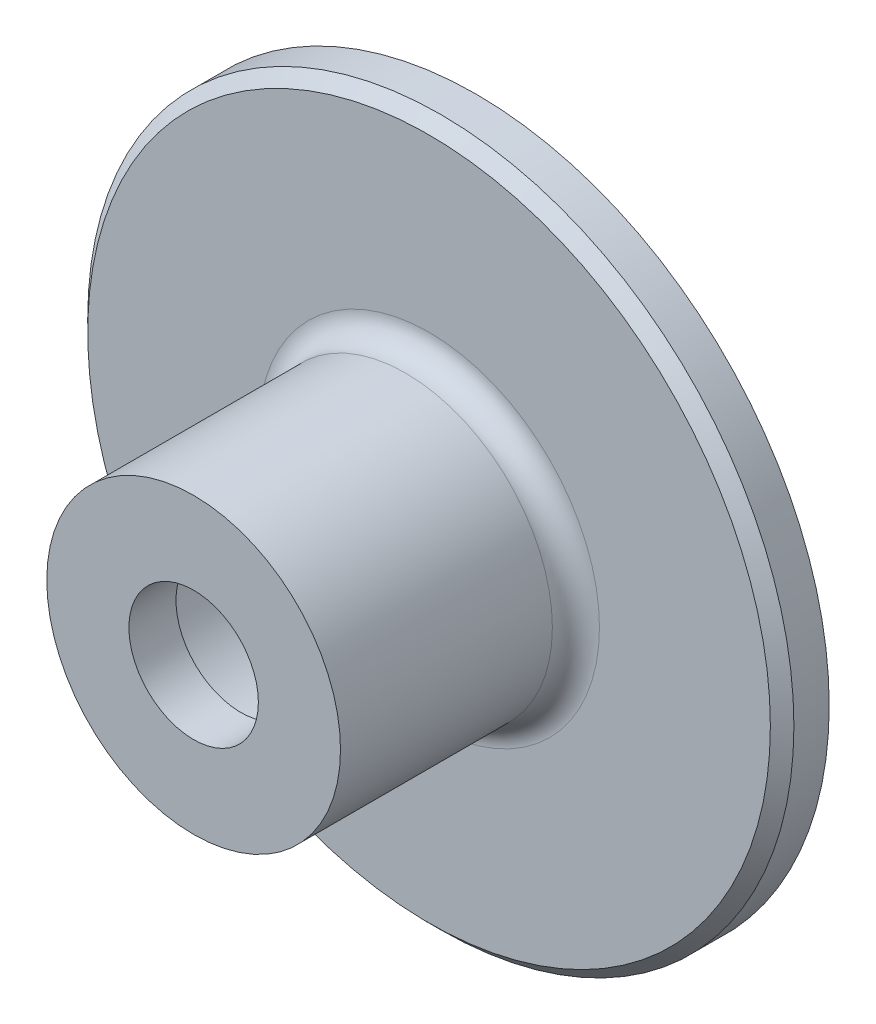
ISO-10303-21;
HEADER;
FILE_DESCRIPTION(('STEP AP214'),'2;1');
FILE_NAME('part.step','',(''),(''),'','','');
FILE_SCHEMA(('AUTOMOTIVE_DESIGN { 1 0 10303 214 1 1 1 1 }'));
ENDSEC;
DATA;
#1=APPLICATION_CONTEXT('core data for automotive mechanical design processes');
#2=APPLICATION_PROTOCOL_DEFINITION('international standard','automotive_design',2000,#1);
#3=PRODUCT_CONTEXT('',#1,'mechanical');
#4=PRODUCT('Part','Part','',(#3));
#5=PRODUCT_RELATED_PRODUCT_CATEGORY('part','',(#4));
#6=PRODUCT_DEFINITION_FORMATION('','',#4);
#7=PRODUCT_DEFINITION_CONTEXT('part definition',#1,'design');
#8=PRODUCT_DEFINITION('design','',#6,#7);
#9=PRODUCT_DEFINITION_SHAPE('','',#8);
#10=(LENGTH_UNIT() NAMED_UNIT(*) SI_UNIT(.MILLI.,.METRE.));
#11=(NAMED_UNIT(*) PLANE_ANGLE_UNIT() SI_UNIT($,.RADIAN.));
#12=(NAMED_UNIT(*) SI_UNIT($,.STERADIAN.) SOLID_ANGLE_UNIT());
#13=UNCERTAINTY_MEASURE_WITH_UNIT(LENGTH_MEASURE(1.E-05),#10,'distance_accuracy_value','');
#14=(GEOMETRIC_REPRESENTATION_CONTEXT(3) GLOBAL_UNCERTAINTY_ASSIGNED_CONTEXT((#13)) GLOBAL_UNIT_ASSIGNED_CONTEXT((#10,
#11,#12)) REPRESENTATION_CONTEXT('',''));
#15=CARTESIAN_POINT('',(0.,0.,0.));
#16=DIRECTION('',(0.,0.,1.));
#17=DIRECTION('',(1.,0.,0.));
#18=AXIS2_PLACEMENT_3D('',#15,#16,#17);
#19=CARTESIAN_POINT('',(-28.3658305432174,-486.980432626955,2.));
#20=DIRECTION('',(0.,0.,-1.));
#21=DIRECTION('',(-1.,0.,0.));
#22=AXIS2_PLACEMENT_3D('',#19,#20,#21);
#23=CYLINDRICAL_SURFACE('',#22,4.23900455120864);
#24=CARTESIAN_POINT('',(-28.3658305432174,-486.980432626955,9.5));
#25=DIRECTION('',(0.,0.,1.));
#26=DIRECTION('',(1.,0.,0.));
#27=AXIS2_PLACEMENT_3D('',#24,#25,#26);
#28=CIRCLE('',#27,4.23900455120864);
#29=CARTESIAN_POINT('',(-24.1268259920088,-486.980432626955,9.5));
#30=VERTEX_POINT('',#29);
#31=EDGE_CURVE('E1073',#30,#30,#28,.T.);
#32=ORIENTED_EDGE('',*,*,#31,.T.);
#33=EDGE_LOOP('',(#32));
#34=FACE_BOUND('',#33,.T.);
#35=CARTESIAN_POINT('',(-28.3658305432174,-486.980432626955,0.));
#36=DIRECTION('',(0.,0.,1.));
#37=DIRECTION('',(1.,0.,0.));
#38=AXIS2_PLACEMENT_3D('',#35,#36,#37);
#39=CIRCLE('',#38,4.23900455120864);
#40=CARTESIAN_POINT('',(-24.1268259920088,-486.980432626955,0.));
#41=VERTEX_POINT('',#40);
#42=EDGE_CURVE('E1064',#41,#41,#39,.T.);
#43=ORIENTED_EDGE('',*,*,#42,.F.);
#44=EDGE_LOOP('',(#43));
#45=FACE_BOUND('',#44,.T.);
#46=ADVANCED_FACE('F53',(#34,#45),#23,.F.);
#47=CARTESIAN_POINT('',(0.,0.,2.));
#48=DIRECTION('',(0.,0.,1.));
#49=DIRECTION('',(1.,0.,0.));
#50=AXIS2_PLACEMENT_3D('',#47,#48,#49);
#51=PLANE('',#50);
#52=CARTESIAN_POINT('',(-28.3658305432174,-486.980432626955,2.));
#53=DIRECTION('',(0.,0.,1.));
#54=DIRECTION('',(1.,0.,0.));
#55=AXIS2_PLACEMENT_3D('',#52,#53,#54);
#56=CIRCLE('',#55,14.5);
#57=CARTESIAN_POINT('',(-13.8658305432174,-486.980432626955,2.));
#58=VERTEX_POINT('',#57);
#59=EDGE_CURVE('E12',#58,#58,#56,.T.);
#60=ORIENTED_EDGE('',*,*,#59,.T.);
#61=EDGE_LOOP('',(#60));
#62=FACE_BOUND('',#61,.T.);
#63=CARTESIAN_POINT('',(-28.3658305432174,-486.980432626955,2.));
#64=DIRECTION('',(0.,0.,1.));
#65=DIRECTION('',(1.,0.,0.));
#66=AXIS2_PLACEMENT_3D('',#63,#64,#65);
#67=CIRCLE('',#66,7.23900455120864);
#68=CARTESIAN_POINT('',(-21.1268259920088,-486.980432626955,2.));
#69=VERTEX_POINT('',#68);
#70=EDGE_CURVE('E1067',#69,#69,#67,.F.);
#71=ORIENTED_EDGE('',*,*,#70,.T.);
#72=EDGE_LOOP('',(#71));
#73=FACE_BOUND('',#72,.T.);
#74=ADVANCED_FACE('F1099',(#62,#73),#51,.T.);
#75=CARTESIAN_POINT('',(0.,0.,0.));
#76=DIRECTION('',(0.,0.,1.));
#77=DIRECTION('',(1.,0.,0.));
#78=AXIS2_PLACEMENT_3D('',#75,#76,#77);
#79=PLANE('',#78);
#80=CARTESIAN_POINT('',(-28.3658305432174,-486.980432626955,0.));
#81=DIRECTION('',(0.,0.,-1.));
#82=DIRECTION('',(-1.,0.,0.));
#83=AXIS2_PLACEMENT_3D('',#80,#81,#82);
#84=CIRCLE('',#83,4.73900455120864);
#85=CARTESIAN_POINT('',(-33.0434416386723,-487.740773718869,0.));
#86=VERTEX_POINT('',#85);
#87=CARTESIAN_POINT('',(-31.7031801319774,-483.615872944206,0.));
#88=VERTEX_POINT('',#87);
#89=EDGE_CURVE('E744',#86,#88,#84,.T.);
#90=ORIENTED_EDGE('',*,*,#89,.T.);
#91=CARTESIAN_POINT('',(-36.9949837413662,-492.202339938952,0.));
#92=DIRECTION('',(0.,0.,-1.));
#93=DIRECTION('',(-1.,0.,0.));
#94=AXIS2_PLACEMENT_3D('',#91,#92,#93);
#95=CIRCLE('',#94,10.0861588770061);
#96=CARTESIAN_POINT('',(-35.4571121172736,-482.234112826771,0.));
#97=VERTEX_POINT('',#96);
#98=EDGE_CURVE('E952',#97,#88,#95,.T.);
#99=ORIENTED_EDGE('',*,*,#98,.F.);
#100=DIRECTION('',(0.999783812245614,0.0207925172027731,0.));
#101=VECTOR('',#100,1.);
#102=CARTESIAN_POINT('',(10.0093642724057,-481.288545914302,0.));
#103=LINE('',#102,#101);
#104=CARTESIAN_POINT('',(-38.9459650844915,-482.306670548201,0.));
#105=VERTEX_POINT('',#104);
#106=EDGE_CURVE('E982',#105,#97,#103,.T.);
#107=ORIENTED_EDGE('',*,*,#106,.F.);
#108=DIRECTION('',(-0.587785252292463,0.809016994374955,0.));
#109=VECTOR('',#108,1.);
#110=CARTESIAN_POINT('',(-254.840916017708,-185.152763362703,0.));
#111=LINE('',#110,#109);
#112=CARTESIAN_POINT('',(-37.7703945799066,-483.924704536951,0.));
#113=VERTEX_POINT('',#112);
#114=EDGE_CURVE('E979',#113,#105,#111,.T.);
#115=ORIENTED_EDGE('',*,*,#114,.F.);
#116=DIRECTION('',(-0.951056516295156,-0.30901699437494,0.));
#117=VECTOR('',#116,1.);
#118=CARTESIAN_POINT('',(138.615150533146,-426.613566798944,0.));
#119=LINE('',#118,#117);
#120=CARTESIAN_POINT('',(-39.672507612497,-484.5427385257,0.));
#121=VERTEX_POINT('',#120);
#122=EDGE_CURVE('E976',#113,#121,#119,.T.);
#123=ORIENTED_EDGE('',*,*,#122,.T.);
#124=DIRECTION('',(0.796620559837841,-0.604479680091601,0.));
#125=VECTOR('',#124,1.);
#126=CARTESIAN_POINT('',(-247.823329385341,-326.596849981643,0.));
#127=LINE('',#126,#125);
#128=CARTESIAN_POINT('',(-36.8926146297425,-486.652135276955,0.));
#129=VERTEX_POINT('',#128);
#130=EDGE_CURVE('E973',#121,#129,#127,.T.);
#131=ORIENTED_EDGE('',*,*,#130,.T.);
#132=CARTESIAN_POINT('',(-32.2776020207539,-477.683731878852,0.));
#133=DIRECTION('',(0.,0.,-1.));
#134=DIRECTION('',(-1.,0.,0.));
#135=AXIS2_PLACEMENT_3D('',#132,#133,#134);
#136=CIRCLE('',#135,10.0861588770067);
#137=EDGE_CURVE('E970',#129,#86,#136,.F.);
#138=ORIENTED_EDGE('',*,*,#137,.T.);
#139=EDGE_LOOP('',(#90,#99,#107,#115,#123,#131,#138));
#140=FACE_BOUND('',#139,.T.);
#141=CARTESIAN_POINT('',(-28.3658305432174,-486.980432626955,0.));
#142=DIRECTION('',(0.,0.,-1.));
#143=DIRECTION('',(-1.,0.,0.));
#144=AXIS2_PLACEMENT_3D('',#141,#142,#143);
#145=CIRCLE('',#144,4.73900455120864);
#146=CARTESIAN_POINT('',(-29.0881645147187,-491.664063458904,0.));
#147=VERTEX_POINT('',#146);
#148=CARTESIAN_POINT('',(-32.5970146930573,-489.114734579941,0.));
#149=VERTEX_POINT('',#148);
#150=EDGE_CURVE('E915',#147,#149,#145,.T.);
#151=ORIENTED_EDGE('',*,*,#150,.T.);
#152=CARTESIAN_POINT('',(-26.0660565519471,-496.80090310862,0.));
#153=DIRECTION('',(0.,0.,-1.));
#154=DIRECTION('',(-1.,0.,0.));
#155=AXIS2_PLACEMENT_3D('',#152,#153,#154);
#156=CIRCLE('',#155,10.0861588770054);
#157=CARTESIAN_POINT('',(-35.0711754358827,-492.257948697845,0.));
#158=VERTEX_POINT('',#157);
#159=EDGE_CURVE('E899',#158,#149,#156,.T.);
#160=ORIENTED_EDGE('',*,*,#159,.F.);
#161=DIRECTION('',(0.289175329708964,0.957276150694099,0.));
#162=VECTOR('',#161,1.);
#163=CARTESIAN_POINT('',(104.128723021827,-31.4553515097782,0.));
#164=LINE('',#163,#162);
#165=CARTESIAN_POINT('',(-36.0802837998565,-495.598466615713,0.));
#166=VERTEX_POINT('',#165);
#167=EDGE_CURVE('E931',#166,#158,#164,.T.);
#168=ORIENTED_EDGE('',*,*,#167,.F.);
#169=DIRECTION('',(-0.951056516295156,-0.30901699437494,0.));
#170=VECTOR('',#169,1.);
#171=CARTESIAN_POINT('',(142.207374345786,-437.669294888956,0.));
#172=LINE('',#171,#170);
#173=CARTESIAN_POINT('',(-34.1781707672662,-494.980432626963,0.));
#174=VERTEX_POINT('',#173);
#175=EDGE_CURVE('E928',#174,#166,#172,.T.);
#176=ORIENTED_EDGE('',*,*,#175,.F.);
#177=DIRECTION('',(0.,-1.,0.));
#178=VECTOR('',#177,1.);
#179=CARTESIAN_POINT('',(-34.1781707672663,0.,0.));
#180=LINE('',#179,#178);
#181=CARTESIAN_POINT('',(-34.178170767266,-496.980432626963,0.));
#182=VERTEX_POINT('',#181);
#183=EDGE_CURVE('E925',#174,#182,#180,.T.);
#184=ORIENTED_EDGE('',*,*,#183,.T.);
#185=DIRECTION('',(0.821063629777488,0.57083668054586,0.));
#186=VECTOR('',#185,1.);
#187=CARTESIAN_POINT('',(221.794256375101,-319.018036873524,0.));
#188=LINE('',#187,#186);
#189=CARTESIAN_POINT('',(-31.3129810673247,-494.988436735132,0.));
#190=VERTEX_POINT('',#189);
#191=EDGE_CURVE('E922',#182,#190,#188,.T.);
#192=ORIENTED_EDGE('',*,*,#191,.T.);
#193=CARTESIAN_POINT('',(-38.4163222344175,-487.82790985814,0.));
#194=DIRECTION('',(0.,0.,-1.));
#195=DIRECTION('',(-1.,0.,0.));
#196=AXIS2_PLACEMENT_3D('',#193,#194,#195);
#197=CIRCLE('',#196,10.0861588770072);
#198=EDGE_CURVE('E918',#190,#147,#197,.F.);
#199=ORIENTED_EDGE('',*,*,#198,.T.);
#200=EDGE_LOOP('',(#151,#160,#168,#176,#184,#192,#199));
#201=FACE_BOUND('',#200,.T.);
#202=CARTESIAN_POINT('',(-28.3658305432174,-486.980432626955,0.));
#203=DIRECTION('',(0.,0.,-1.));
#204=DIRECTION('',(-1.,0.,0.));
#205=AXIS2_PLACEMENT_3D('',#202,#203,#204);
#206=CIRCLE('',#205,4.73900455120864);
#207=CARTESIAN_POINT('',(-24.134646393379,-489.114734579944,0.));
#208=VERTEX_POINT('',#207);
#209=CARTESIAN_POINT('',(-27.6434965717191,-491.664063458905,0.));
#210=VERTEX_POINT('',#209);
#211=EDGE_CURVE('E862',#208,#210,#206,.T.);
#212=ORIENTED_EDGE('',*,*,#211,.T.);
#213=CARTESIAN_POINT('',(-18.3153388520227,-487.827909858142,0.));
#214=DIRECTION('',(0.,0.,-1.));
#215=DIRECTION('',(-1.,0.,0.));
#216=AXIS2_PLACEMENT_3D('',#213,#214,#215);
#217=CIRCLE('',#216,10.0861588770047);
#218=CARTESIAN_POINT('',(-25.4186800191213,-494.988436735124,0.));
#219=VERTEX_POINT('',#218);
#220=EDGE_CURVE('E846',#219,#210,#217,.T.);
#221=ORIENTED_EDGE('',*,*,#220,.F.);
#222=DIRECTION('',(-0.821063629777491,0.570836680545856,0.));
#223=VECTOR('',#222,1.);
#224=CARTESIAN_POINT('',(-240.280524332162,-345.607782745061,0.));
#225=LINE('',#224,#223);
#226=CARTESIAN_POINT('',(-22.5534903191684,-496.980432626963,0.));
#227=VERTEX_POINT('',#226);
#228=EDGE_CURVE('E878',#227,#219,#225,.T.);
#229=ORIENTED_EDGE('',*,*,#228,.F.);
#230=DIRECTION('',(0.,-1.,0.));
#231=VECTOR('',#230,1.);
#232=CARTESIAN_POINT('',(-22.5534903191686,0.,0.));
#233=LINE('',#232,#231);
#234=CARTESIAN_POINT('',(-22.5534903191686,-494.980432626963,0.));
#235=VERTEX_POINT('',#234);
#236=EDGE_CURVE('E875',#235,#227,#233,.T.);
#237=ORIENTED_EDGE('',*,*,#236,.F.);
#238=DIRECTION('',(0.951056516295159,-0.309016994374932,0.));
#239=VECTOR('',#238,1.);
#240=CARTESIAN_POINT('',(-147.624765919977,-454.342311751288,0.));
#241=LINE('',#240,#239);
#242=CARTESIAN_POINT('',(-20.6513772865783,-495.598466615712,0.));
#243=VERTEX_POINT('',#242);
#244=EDGE_CURVE('E872',#235,#243,#241,.T.);
#245=ORIENTED_EDGE('',*,*,#244,.T.);
#246=DIRECTION('',(-0.289175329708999,0.957276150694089,0.));
#247=VECTOR('',#246,1.);
#248=CARTESIAN_POINT('',(-156.116348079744,-47.1598466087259,0.));
#249=LINE('',#248,#247);
#250=CARTESIAN_POINT('',(-21.6604856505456,-492.257948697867,0.));
#251=VERTEX_POINT('',#250);
#252=EDGE_CURVE('E869',#243,#251,#249,.T.);
#253=ORIENTED_EDGE('',*,*,#252,.T.);
#254=CARTESIAN_POINT('',(-30.665604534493,-496.800903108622,0.));
#255=DIRECTION('',(0.,0.,-1.));
#256=DIRECTION('',(-1.,0.,0.));
#257=AXIS2_PLACEMENT_3D('',#254,#255,#256);
#258=CIRCLE('',#257,10.0861588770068);
#259=EDGE_CURVE('E865',#251,#208,#258,.F.);
#260=ORIENTED_EDGE('',*,*,#259,.T.);
#261=EDGE_LOOP('',(#212,#221,#229,#237,#245,#253,#260));
#262=FACE_BOUND('',#261,.T.);
#263=CARTESIAN_POINT('',(-28.3658305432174,-486.980432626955,0.));
#264=DIRECTION('',(0.,0.,-1.));
#265=DIRECTION('',(-1.,0.,0.));
#266=AXIS2_PLACEMENT_3D('',#263,#264,#265);
#267=CIRCLE('',#266,4.73900455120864);
#268=CARTESIAN_POINT('',(-25.0284809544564,-483.615872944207,0.));
#269=VERTEX_POINT('',#268);
#270=CARTESIAN_POINT('',(-23.6882194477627,-487.74077371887,0.));
#271=VERTEX_POINT('',#270);
#272=EDGE_CURVE('E807',#269,#271,#267,.T.);
#273=ORIENTED_EDGE('',*,*,#272,.T.);
#274=CARTESIAN_POINT('',(-24.4540590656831,-477.683731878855,0.));
#275=DIRECTION('',(0.,0.,-1.));
#276=DIRECTION('',(-1.,0.,0.));
#277=AXIS2_PLACEMENT_3D('',#274,#275,#276);
#278=CIRCLE('',#277,10.086158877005);
#279=CARTESIAN_POINT('',(-19.8390464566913,-486.652135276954,0.));
#280=VERTEX_POINT('',#279);
#281=EDGE_CURVE('E791',#280,#271,#278,.T.);
#282=ORIENTED_EDGE('',*,*,#281,.F.);
#283=DIRECTION('',(-0.796620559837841,-0.604479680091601,0.));
#284=VECTOR('',#283,1.);
#285=CARTESIAN_POINT('',(227.093825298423,-299.278232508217,0.));
#286=LINE('',#285,#284);
#287=CARTESIAN_POINT('',(-17.0591534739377,-484.5427385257,0.));
#288=VERTEX_POINT('',#287);
#289=EDGE_CURVE('E823',#288,#280,#286,.T.);
#290=ORIENTED_EDGE('',*,*,#289,.F.);
#291=DIRECTION('',(0.951056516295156,-0.30901699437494,0.));
#292=VECTOR('',#291,1.);
#293=CARTESIAN_POINT('',(-144.03254210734,-443.286583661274,0.));
#294=LINE('',#293,#292);
#295=CARTESIAN_POINT('',(-18.9612665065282,-483.924704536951,0.));
#296=VERTEX_POINT('',#295);
#297=EDGE_CURVE('E820',#296,#288,#294,.T.);
#298=ORIENTED_EDGE('',*,*,#297,.F.);
#299=DIRECTION('',(0.587785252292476,0.809016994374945,0.));
#300=VECTOR('',#299,1.);
#301=CARTESIAN_POINT('',(217.709561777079,-158.175255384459,0.));
#302=LINE('',#301,#300);
#303=CARTESIAN_POINT('',(-17.7856960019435,-482.306670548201,0.));
#304=VERTEX_POINT('',#303);
#305=EDGE_CURVE('E817',#296,#304,#302,.T.);
#306=ORIENTED_EDGE('',*,*,#305,.T.);
#307=DIRECTION('',(-0.999783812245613,0.0207925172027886,0.));
#308=VECTOR('',#307,1.);
#309=CARTESIAN_POINT('',(-10.033891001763,-482.467884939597,0.));
#310=LINE('',#309,#308);
#311=CARTESIAN_POINT('',(-21.2745489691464,-482.234112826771,0.));
#312=VERTEX_POINT('',#311);
#313=EDGE_CURVE('E814',#304,#312,#310,.T.);
#314=ORIENTED_EDGE('',*,*,#313,.T.);
#315=CARTESIAN_POINT('',(-19.7366773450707,-492.202339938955,0.));
#316=DIRECTION('',(0.,0.,-1.));
#317=DIRECTION('',(-1.,0.,0.));
#318=AXIS2_PLACEMENT_3D('',#315,#316,#317);
#319=CIRCLE('',#318,10.0861588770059);
#320=EDGE_CURVE('E810',#312,#269,#319,.F.);
#321=ORIENTED_EDGE('',*,*,#320,.T.);
#322=EDGE_LOOP('',(#273,#282,#290,#298,#306,#314,#321));
#323=FACE_BOUND('',#322,.T.);
#324=CARTESIAN_POINT('',(-28.3658305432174,-486.980432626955,0.));
#325=DIRECTION('',(0.,0.,-1.));
#326=DIRECTION('',(-1.,0.,0.));
#327=AXIS2_PLACEMENT_3D('',#324,#325,#326);
#328=CIRCLE('',#327,4.73900455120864);
#329=CARTESIAN_POINT('',(-30.5344192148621,-482.766718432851,0.));
#330=VERTEX_POINT('',#329);
#331=CARTESIAN_POINT('',(-26.1972418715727,-482.766718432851,0.));
#332=VERTEX_POINT('',#331);
#333=EDGE_CURVE('E830',#330,#332,#328,.T.);
#334=ORIENTED_EDGE('',*,*,#333,.T.);
#335=CARTESIAN_POINT('',(-35.9987145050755,-480.387278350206,0.));
#336=DIRECTION('',(0.,0.,-1.));
#337=DIRECTION('',(-1.,0.,0.));
#338=AXIS2_PLACEMENT_3D('',#335,#336,#337);
#339=CIRCLE('',#338,10.0861588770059);
#340=CARTESIAN_POINT('',(-26.0431386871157,-478.769529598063,0.));
#341=VERTEX_POINT('',#340);
#342=EDGE_CURVE('E1003',#341,#332,#339,.T.);
#343=ORIENTED_EDGE('',*,*,#342,.F.);
#344=DIRECTION('',(0.328725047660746,-0.94442566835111,0.));
#345=VECTOR('',#344,1.);
#346=CARTESIAN_POINT('',(-171.865964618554,-59.821168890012,0.));
#347=LINE('',#346,#345);
#348=CARTESIAN_POINT('',(-27.1902600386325,-475.473854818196,0.));
#349=VERTEX_POINT('',#348);
#350=EDGE_CURVE('E1033',#349,#341,#347,.T.);
#351=ORIENTED_EDGE('',*,*,#350,.F.);
#352=DIRECTION('',(0.587785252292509,0.809016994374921,0.));
#353=VECTOR('',#352,1.);
#354=CARTESIAN_POINT('',(208.304997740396,-151.342439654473,0.));
#355=LINE('',#354,#353);
#356=CARTESIAN_POINT('',(-28.3658305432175,-477.091888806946,0.));
#357=VERTEX_POINT('',#356);
#358=EDGE_CURVE('E1030',#357,#349,#355,.T.);
#359=ORIENTED_EDGE('',*,*,#358,.F.);
#360=DIRECTION('',(-0.587785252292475,0.809016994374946,0.));
#361=VECTOR('',#360,1.);
#362=CARTESIAN_POINT('',(-245.436351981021,-178.319947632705,0.));
#363=LINE('',#362,#361);
#364=CARTESIAN_POINT('',(-29.5414010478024,-475.473854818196,0.));
#365=VERTEX_POINT('',#364);
#366=EDGE_CURVE('E1027',#357,#365,#363,.T.);
#367=ORIENTED_EDGE('',*,*,#366,.T.);
#368=DIRECTION('',(-0.328725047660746,-0.94442566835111,0.));
#369=VECTOR('',#368,1.);
#370=CARTESIAN_POINT('',(121.264735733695,-42.2084631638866,0.));
#371=LINE('',#370,#369);
#372=CARTESIAN_POINT('',(-30.688522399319,-478.769529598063,0.));
#373=VERTEX_POINT('',#372);
#374=EDGE_CURVE('E1024',#365,#373,#371,.T.);
#375=ORIENTED_EDGE('',*,*,#374,.T.);
#376=CARTESIAN_POINT('',(-20.7329465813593,-480.387278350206,0.));
#377=DIRECTION('',(0.,0.,-1.));
#378=DIRECTION('',(-1.,0.,0.));
#379=AXIS2_PLACEMENT_3D('',#376,#377,#378);
#380=CIRCLE('',#379,10.0861588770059);
#381=EDGE_CURVE('E1021',#373,#330,#380,.F.);
#382=ORIENTED_EDGE('',*,*,#381,.T.);
#383=EDGE_LOOP('',(#334,#343,#351,#359,#367,#375,#382));
#384=FACE_BOUND('',#383,.T.);
#385=ORIENTED_EDGE('',*,*,#42,.T.);
#386=EDGE_LOOP('',(#385));
#387=FACE_BOUND('',#386,.T.);
#388=CARTESIAN_POINT('',(-28.3658305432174,-486.980432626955,0.));
#389=DIRECTION('',(0.,0.,-1.));
#390=DIRECTION('',(-1.,0.,0.));
#391=AXIS2_PLACEMENT_3D('',#388,#389,#390);
#392=CIRCLE('',#391,15.);
#393=CARTESIAN_POINT('',(-43.3658305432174,-486.980432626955,0.));
#394=VERTEX_POINT('',#393);
#395=EDGE_CURVE('E1040',#394,#394,#392,.T.);
#396=ORIENTED_EDGE('',*,*,#395,.T.);
#397=EDGE_LOOP('',(#396));
#398=FACE_BOUND('',#397,.T.);
#399=ADVANCED_FACE('F1106',(#140,#201,#262,#323,#384,#387,#398),#79,.F.);
#400=CARTESIAN_POINT('',(-28.3658305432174,-486.980432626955,10.));
#401=DIRECTION('',(0.,0.,-1.));
#402=DIRECTION('',(-1.,0.,0.));
#403=AXIS2_PLACEMENT_3D('',#400,#401,#402);
#404=CYLINDRICAL_SURFACE('',#403,6.23900455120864);
#405=CARTESIAN_POINT('',(-28.3658305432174,-486.980432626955,3.));
#406=DIRECTION('',(0.,0.,1.));
#407=DIRECTION('',(1.,0.,0.));
#408=AXIS2_PLACEMENT_3D('',#405,#406,#407);
#409=CIRCLE('',#408,6.23900455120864);
#410=CARTESIAN_POINT('',(-22.1268259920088,-486.980432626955,3.));
#411=VERTEX_POINT('',#410);
#412=EDGE_CURVE('E1070',#411,#411,#409,.T.);
#413=ORIENTED_EDGE('',*,*,#412,.T.);
#414=EDGE_LOOP('',(#413));
#415=FACE_BOUND('',#414,.T.);
#416=CARTESIAN_POINT('',(-28.3658305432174,-486.980432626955,12.));
#417=DIRECTION('',(0.,0.,1.));
#418=DIRECTION('',(1.,0.,0.));
#419=AXIS2_PLACEMENT_3D('',#416,#417,#418);
#420=CIRCLE('',#419,6.23900455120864);
#421=CARTESIAN_POINT('',(-22.1268259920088,-486.980432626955,12.));
#422=VERTEX_POINT('',#421);
#423=EDGE_CURVE('E1059',#422,#422,#420,.T.);
#424=ORIENTED_EDGE('',*,*,#423,.F.);
#425=EDGE_LOOP('',(#424));
#426=FACE_BOUND('',#425,.T.);
#427=ADVANCED_FACE('F1127',(#415,#426),#404,.T.);
#428=CARTESIAN_POINT('',(-28.3658305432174,-486.980432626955,10.));
#429=DIRECTION('',(0.,0.,1.));
#430=DIRECTION('',(1.,0.,0.));
#431=AXIS2_PLACEMENT_3D('',#428,#429,#430);
#432=PLANE('',#431);
#433=CARTESIAN_POINT('',(-28.3658305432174,-486.980432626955,10.));
#434=DIRECTION('',(0.,0.,1.));
#435=DIRECTION('',(1.,0.,0.));
#436=AXIS2_PLACEMENT_3D('',#433,#434,#435);
#437=CIRCLE('',#436,3.73900455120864);
#438=CARTESIAN_POINT('',(-24.6268259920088,-486.980432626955,10.));
#439=VERTEX_POINT('',#438);
#440=EDGE_CURVE('E1076',#439,#439,#437,.F.);
#441=ORIENTED_EDGE('',*,*,#440,.T.);
#442=EDGE_LOOP('',(#441));
#443=FACE_BOUND('',#442,.T.);
#444=CARTESIAN_POINT('',(-28.3658305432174,-486.980432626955,10.));
#445=DIRECTION('',(0.,0.,1.));
#446=DIRECTION('',(1.,0.,0.));
#447=AXIS2_PLACEMENT_3D('',#444,#445,#446);
#448=CIRCLE('',#447,2.75);
#449=CARTESIAN_POINT('',(-25.6158305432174,-486.980432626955,10.));
#450=VERTEX_POINT('',#449);
#451=EDGE_CURVE('E1055',#450,#450,#448,.T.);
#452=ORIENTED_EDGE('',*,*,#451,.T.);
#453=EDGE_LOOP('',(#452));
#454=FACE_BOUND('',#453,.T.);
#455=ADVANCED_FACE('F1124',(#443,#454),#432,.F.);
#456=CARTESIAN_POINT('',(-28.3658305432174,-486.980432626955,12.));
#457=DIRECTION('',(0.,0.,1.));
#458=DIRECTION('',(1.,0.,0.));
#459=AXIS2_PLACEMENT_3D('',#456,#457,#458);
#460=PLANE('',#459);
#461=ORIENTED_EDGE('',*,*,#423,.T.);
#462=EDGE_LOOP('',(#461));
#463=FACE_BOUND('',#462,.T.);
#464=CARTESIAN_POINT('',(-28.3658305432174,-486.980432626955,12.));
#465=DIRECTION('',(0.,0.,1.));
#466=DIRECTION('',(1.,0.,0.));
#467=AXIS2_PLACEMENT_3D('',#464,#465,#466);
#468=CIRCLE('',#467,2.75);
#469=CARTESIAN_POINT('',(-25.6158305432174,-486.980432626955,12.));
#470=VERTEX_POINT('',#469);
#471=EDGE_CURVE('E1056',#470,#470,#468,.T.);
#472=ORIENTED_EDGE('',*,*,#471,.F.);
#473=EDGE_LOOP('',(#472));
#474=FACE_BOUND('',#473,.T.);
#475=ADVANCED_FACE('F1126',(#463,#474),#460,.T.);
#476=CARTESIAN_POINT('',(-28.3658305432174,-486.980432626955,12.));
#477=DIRECTION('',(0.,0.,-1.));
#478=DIRECTION('',(-1.,0.,0.));
#479=AXIS2_PLACEMENT_3D('',#476,#477,#478);
#480=CYLINDRICAL_SURFACE('',#479,2.75);
#481=ORIENTED_EDGE('',*,*,#471,.T.);
#482=EDGE_LOOP('',(#481));
#483=FACE_BOUND('',#482,.T.);
#484=ORIENTED_EDGE('',*,*,#451,.F.);
#485=EDGE_LOOP('',(#484));
#486=FACE_BOUND('',#485,.T.);
#487=ADVANCED_FACE('F1114',(#483,#486),#480,.F.);
#488=CARTESIAN_POINT('',(-28.3658305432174,-486.980432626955,3.));
#489=DIRECTION('',(0.,0.,1.));
#490=DIRECTION('',(1.,0.,0.));
#491=AXIS2_PLACEMENT_3D('',#488,#489,#490);
#492=TOROIDAL_SURFACE('',#491,7.23900455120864,1.);
#493=ORIENTED_EDGE('',*,*,#412,.F.);
#494=EDGE_LOOP('',(#493));
#495=FACE_BOUND('',#494,.T.);
#496=ORIENTED_EDGE('',*,*,#70,.F.);
#497=EDGE_LOOP('',(#496));
#498=FACE_BOUND('',#497,.T.);
#499=ADVANCED_FACE('F1112',(#495,#498),#492,.F.);
#500=CARTESIAN_POINT('',(-28.3658305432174,-486.980432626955,9.5));
#501=DIRECTION('',(0.,0.,1.));
#502=DIRECTION('',(1.,0.,0.));
#503=AXIS2_PLACEMENT_3D('',#500,#501,#502);
#504=TOROIDAL_SURFACE('',#503,3.73900455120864,0.5);
#505=ORIENTED_EDGE('',*,*,#440,.F.);
#506=EDGE_LOOP('',(#505));
#507=FACE_BOUND('',#506,.T.);
#508=ORIENTED_EDGE('',*,*,#31,.F.);
#509=EDGE_LOOP('',(#508));
#510=FACE_BOUND('',#509,.T.);
#511=ADVANCED_FACE('F1095',(#507,#510),#504,.F.);
#512=CARTESIAN_POINT('',(-28.3658305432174,-486.980432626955,44.4264068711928));
#513=DIRECTION('',(0.,0.,-1.));
#514=DIRECTION('',(-1.,0.,0.));
#515=AXIS2_PLACEMENT_3D('',#512,#513,#514);
#516=CYLINDRICAL_SURFACE('',#515,15.);
#517=CARTESIAN_POINT('',(-28.3658305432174,-486.980432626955,1.5));
#518=DIRECTION('',(0.,0.,1.));
#519=DIRECTION('',(1.,0.,0.));
#520=AXIS2_PLACEMENT_3D('',#517,#518,#519);
#521=CIRCLE('',#520,15.);
#522=CARTESIAN_POINT('',(-13.3658305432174,-486.980432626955,1.5));
#523=VERTEX_POINT('',#522);
#524=EDGE_CURVE('E62',#523,#523,#521,.F.);
#525=ORIENTED_EDGE('',*,*,#524,.T.);
#526=EDGE_LOOP('',(#525));
#527=FACE_BOUND('',#526,.T.);
#528=ORIENTED_EDGE('',*,*,#395,.F.);
#529=EDGE_LOOP('',(#528));
#530=FACE_BOUND('',#529,.T.);
#531=ADVANCED_FACE('F1081',(#527,#530),#516,.T.);
#532=CARTESIAN_POINT('',(-28.3658305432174,-486.980432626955,1.5));
#533=DIRECTION('',(0.,0.,-1.));
#534=DIRECTION('',(-1.,0.,0.));
#535=AXIS2_PLACEMENT_3D('',#532,#533,#534);
#536=CONICAL_SURFACE('',#535,15.,0.78539816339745);
#537=ORIENTED_EDGE('',*,*,#59,.F.);
#538=EDGE_LOOP('',(#537));
#539=FACE_BOUND('',#538,.T.);
#540=ORIENTED_EDGE('',*,*,#524,.F.);
#541=EDGE_LOOP('',(#540));
#542=FACE_BOUND('',#541,.T.);
#543=ADVANCED_FACE('F56',(#539,#542),#536,.T.);
#544=CARTESIAN_POINT('',(-28.3658305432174,-486.980432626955,1.));
#545=DIRECTION('',(0.,0.,-1.));
#546=DIRECTION('',(-1.,0.,0.));
#547=AXIS2_PLACEMENT_3D('',#544,#545,#546);
#548=CYLINDRICAL_SURFACE('',#547,4.73900455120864);
#549=ORIENTED_EDGE('',*,*,#333,.F.);
#550=DIRECTION('',(0.,0.,-1.));
#551=VECTOR('',#550,1.);
#552=CARTESIAN_POINT('',(-30.5344192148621,-482.766718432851,1.));
#553=LINE('',#552,#551);
#554=CARTESIAN_POINT('',(-30.5344192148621,-482.766718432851,1.));
#555=VERTEX_POINT('',#554);
#556=EDGE_CURVE('E1018',#555,#330,#553,.T.);
#557=ORIENTED_EDGE('',*,*,#556,.F.);
#558=CARTESIAN_POINT('',(-28.3658305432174,-486.980432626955,1.));
#559=DIRECTION('',(0.,0.,-1.));
#560=DIRECTION('',(-1.,0.,0.));
#561=AXIS2_PLACEMENT_3D('',#558,#559,#560);
#562=CIRCLE('',#561,4.73900455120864);
#563=CARTESIAN_POINT('',(-26.1972418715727,-482.766718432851,1.));
#564=VERTEX_POINT('',#563);
#565=EDGE_CURVE('E1000',#555,#564,#562,.T.);
#566=ORIENTED_EDGE('',*,*,#565,.T.);
#567=DIRECTION('',(0.,0.,-1.));
#568=VECTOR('',#567,1.);
#569=CARTESIAN_POINT('',(-26.1972418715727,-482.766718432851,1.));
#570=LINE('',#569,#568);
#571=EDGE_CURVE('E1038',#564,#332,#570,.T.);
#572=ORIENTED_EDGE('',*,*,#571,.T.);
#573=EDGE_LOOP('',(#549,#557,#566,#572));
#574=FACE_BOUND('',#573,.T.);
#575=ADVANCED_FACE('F1085',(#574),#548,.T.);
#576=CARTESIAN_POINT('',(-35.9987145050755,-480.387278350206,1.));
#577=DIRECTION('',(0.,0.,-1.));
#578=DIRECTION('',(-1.,0.,0.));
#579=AXIS2_PLACEMENT_3D('',#576,#577,#578);
#580=CYLINDRICAL_SURFACE('',#579,10.0861588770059);
#581=ORIENTED_EDGE('',*,*,#342,.T.);
#582=ORIENTED_EDGE('',*,*,#571,.F.);
#583=CARTESIAN_POINT('',(-35.9987145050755,-480.387278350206,1.));
#584=DIRECTION('',(0.,0.,-1.));
#585=DIRECTION('',(-1.,0.,0.));
#586=AXIS2_PLACEMENT_3D('',#583,#584,#585);
#587=CIRCLE('',#586,10.0861588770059);
#588=CARTESIAN_POINT('',(-26.0431386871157,-478.769529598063,1.));
#589=VERTEX_POINT('',#588);
#590=EDGE_CURVE('E1015',#589,#564,#587,.T.);
#591=ORIENTED_EDGE('',*,*,#590,.F.);
#592=DIRECTION('',(0.,0.,-1.));
#593=VECTOR('',#592,1.);
#594=CARTESIAN_POINT('',(-26.0431386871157,-478.769529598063,1.));
#595=LINE('',#594,#593);
#596=EDGE_CURVE('E1041',#589,#341,#595,.T.);
#597=ORIENTED_EDGE('',*,*,#596,.T.);
#598=EDGE_LOOP('',(#581,#582,#591,#597));
#599=FACE_BOUND('',#598,.T.);
#600=ADVANCED_FACE('F1092',(#599),#580,.F.);
#601=CARTESIAN_POINT('',(-171.865964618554,-59.821168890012,1.));
#602=DIRECTION('',(0.94442566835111,0.328725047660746,0.));
#603=DIRECTION('',(-0.328725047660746,0.94442566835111,0.));
#604=AXIS2_PLACEMENT_3D('',#601,#602,#603);
#605=PLANE('',#604);
#606=ORIENTED_EDGE('',*,*,#350,.T.);
#607=ORIENTED_EDGE('',*,*,#596,.F.);
#608=DIRECTION('',(0.328725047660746,-0.94442566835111,0.));
#609=VECTOR('',#608,1.);
#610=CARTESIAN_POINT('',(-171.865964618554,-59.821168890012,1.));
#611=LINE('',#610,#609);
#612=CARTESIAN_POINT('',(-27.1902600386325,-475.473854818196,1.));
#613=VERTEX_POINT('',#612);
#614=EDGE_CURVE('E1012',#613,#589,#611,.T.);
#615=ORIENTED_EDGE('',*,*,#614,.F.);
#616=DIRECTION('',(0.,0.,-1.));
#617=VECTOR('',#616,1.);
#618=CARTESIAN_POINT('',(-27.1902600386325,-475.473854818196,1.));
#619=LINE('',#618,#617);
#620=EDGE_CURVE('E1043',#613,#349,#619,.T.);
#621=ORIENTED_EDGE('',*,*,#620,.T.);
#622=EDGE_LOOP('',(#606,#607,#615,#621));
#623=FACE_BOUND('',#622,.T.);
#624=ADVANCED_FACE('F1183',(#623),#605,.F.);
#625=CARTESIAN_POINT('',(208.304997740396,-151.342439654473,1.));
#626=DIRECTION('',(-0.809016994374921,0.587785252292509,0.));
#627=DIRECTION('',(-0.587785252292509,-0.809016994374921,0.));
#628=AXIS2_PLACEMENT_3D('',#625,#626,#627);
#629=PLANE('',#628);
#630=ORIENTED_EDGE('',*,*,#358,.T.);
#631=ORIENTED_EDGE('',*,*,#620,.F.);
#632=DIRECTION('',(0.587785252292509,0.809016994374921,0.));
#633=VECTOR('',#632,1.);
#634=CARTESIAN_POINT('',(208.304997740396,-151.342439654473,1.));
#635=LINE('',#634,#633);
#636=CARTESIAN_POINT('',(-28.3658305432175,-477.091888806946,1.));
#637=VERTEX_POINT('',#636);
#638=EDGE_CURVE('E1009',#637,#613,#635,.T.);
#639=ORIENTED_EDGE('',*,*,#638,.F.);
#640=DIRECTION('',(0.,0.,-1.));
#641=VECTOR('',#640,1.);
#642=CARTESIAN_POINT('',(-28.3658305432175,-477.091888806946,1.));
#643=LINE('',#642,#641);
#644=EDGE_CURVE('E1045',#637,#357,#643,.T.);
#645=ORIENTED_EDGE('',*,*,#644,.T.);
#646=EDGE_LOOP('',(#630,#631,#639,#645));
#647=FACE_BOUND('',#646,.T.);
#648=ADVANCED_FACE('F1187',(#647),#629,.F.);
#649=CARTESIAN_POINT('',(-245.436351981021,-178.319947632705,1.));
#650=DIRECTION('',(-0.809016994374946,-0.587785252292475,0.));
#651=DIRECTION('',(0.587785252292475,-0.809016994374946,0.));
#652=AXIS2_PLACEMENT_3D('',#649,#650,#651);
#653=PLANE('',#652);
#654=ORIENTED_EDGE('',*,*,#366,.F.);
#655=ORIENTED_EDGE('',*,*,#644,.F.);
#656=DIRECTION('',(-0.587785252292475,0.809016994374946,0.));
#657=VECTOR('',#656,1.);
#658=CARTESIAN_POINT('',(-245.436351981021,-178.319947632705,1.));
#659=LINE('',#658,#657);
#660=CARTESIAN_POINT('',(-29.5414010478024,-475.473854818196,1.));
#661=VERTEX_POINT('',#660);
#662=EDGE_CURVE('E1007',#637,#661,#659,.T.);
#663=ORIENTED_EDGE('',*,*,#662,.T.);
#664=DIRECTION('',(0.,0.,-1.));
#665=VECTOR('',#664,1.);
#666=CARTESIAN_POINT('',(-29.5414010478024,-475.473854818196,1.));
#667=LINE('',#666,#665);
#668=EDGE_CURVE('E1047',#661,#365,#667,.T.);
#669=ORIENTED_EDGE('',*,*,#668,.T.);
#670=EDGE_LOOP('',(#654,#655,#663,#669));
#671=FACE_BOUND('',#670,.T.);
#672=ADVANCED_FACE('F1190',(#671),#653,.T.);
#673=CARTESIAN_POINT('',(121.264735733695,-42.2084631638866,1.));
#674=DIRECTION('',(0.94442566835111,-0.328725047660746,0.));
#675=DIRECTION('',(0.328725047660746,0.94442566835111,0.));
#676=AXIS2_PLACEMENT_3D('',#673,#674,#675);
#677=PLANE('',#676);
#678=ORIENTED_EDGE('',*,*,#374,.F.);
#679=ORIENTED_EDGE('',*,*,#668,.F.);
#680=DIRECTION('',(-0.328725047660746,-0.94442566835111,0.));
#681=VECTOR('',#680,1.);
#682=CARTESIAN_POINT('',(121.264735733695,-42.2084631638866,1.));
#683=LINE('',#682,#681);
#684=CARTESIAN_POINT('',(-30.688522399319,-478.769529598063,1.));
#685=VERTEX_POINT('',#684);
#686=EDGE_CURVE('E1005',#661,#685,#683,.T.);
#687=ORIENTED_EDGE('',*,*,#686,.T.);
#688=DIRECTION('',(0.,0.,-1.));
#689=VECTOR('',#688,1.);
#690=CARTESIAN_POINT('',(-30.688522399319,-478.769529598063,1.));
#691=LINE('',#690,#689);
#692=EDGE_CURVE('E1049',#685,#373,#691,.T.);
#693=ORIENTED_EDGE('',*,*,#692,.T.);
#694=EDGE_LOOP('',(#678,#679,#687,#693));
#695=FACE_BOUND('',#694,.T.);
#696=ADVANCED_FACE('F1194',(#695),#677,.T.);
#697=CARTESIAN_POINT('',(-20.7329465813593,-480.387278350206,1.));
#698=DIRECTION('',(0.,0.,-1.));
#699=DIRECTION('',(-1.,0.,0.));
#700=AXIS2_PLACEMENT_3D('',#697,#698,#699);
#701=CYLINDRICAL_SURFACE('',#700,10.0861588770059);
#702=ORIENTED_EDGE('',*,*,#381,.F.);
#703=ORIENTED_EDGE('',*,*,#692,.F.);
#704=CARTESIAN_POINT('',(-20.7329465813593,-480.387278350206,1.));
#705=DIRECTION('',(0.,0.,-1.));
#706=DIRECTION('',(-1.,0.,0.));
#707=AXIS2_PLACEMENT_3D('',#704,#705,#706);
#708=CIRCLE('',#707,10.0861588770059);
#709=EDGE_CURVE('E1002',#685,#555,#708,.F.);
#710=ORIENTED_EDGE('',*,*,#709,.T.);
#711=ORIENTED_EDGE('',*,*,#556,.T.);
#712=EDGE_LOOP('',(#702,#703,#710,#711));
#713=FACE_BOUND('',#712,.T.);
#714=ADVANCED_FACE('F1174',(#713),#701,.F.);
#715=CARTESIAN_POINT('',(0.,0.,1.));
#716=DIRECTION('',(0.,0.,-1.));
#717=DIRECTION('',(-1.,0.,0.));
#718=AXIS2_PLACEMENT_3D('',#715,#716,#717);
#719=PLANE('',#718);
#720=CARTESIAN_POINT('',(-28.3658305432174,-486.980432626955,1.));
#721=DIRECTION('',(0.,0.,-1.));
#722=DIRECTION('',(-1.,0.,0.));
#723=AXIS2_PLACEMENT_3D('',#720,#721,#722);
#724=CIRCLE('',#723,5.23900455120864);
#725=CARTESIAN_POINT('',(-30.1715999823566,-482.06246908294,1.));
#726=VERTEX_POINT('',#725);
#727=CARTESIAN_POINT('',(-26.5600611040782,-482.06246908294,1.));
#728=VERTEX_POINT('',#727);
#729=EDGE_CURVE('E493',#726,#728,#724,.T.);
#730=ORIENTED_EDGE('',*,*,#729,.T.);
#731=CARTESIAN_POINT('',(-35.9987145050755,-480.387278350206,1.));
#732=DIRECTION('',(0.,0.,-1.));
#733=DIRECTION('',(-1.,0.,0.));
#734=AXIS2_PLACEMENT_3D('',#731,#732,#733);
#735=CIRCLE('',#734,9.58615887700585);
#736=CARTESIAN_POINT('',(-26.5298595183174,-478.892210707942,1.));
#737=VERTEX_POINT('',#736);
#738=EDGE_CURVE('E69',#737,#728,#735,.T.);
#739=ORIENTED_EDGE('',*,*,#738,.F.);
#740=DIRECTION('',(0.328725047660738,-0.944425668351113,0.));
#741=VECTOR('',#740,1.);
#742=CARTESIAN_POINT('',(-172.338177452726,-59.9855314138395,1.));
#743=LINE('',#742,#741);
#744=CARTESIAN_POINT('',(-27.348018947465,-476.541642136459,1.));
#745=VERTEX_POINT('',#744);
#746=EDGE_CURVE('E74',#745,#737,#743,.T.);
#747=ORIENTED_EDGE('',*,*,#746,.F.);
#748=DIRECTION('',(0.587785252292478,0.809016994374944,0.));
#749=VECTOR('',#748,1.);
#750=CARTESIAN_POINT('',(208.709506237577,-151.636332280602,1.));
#751=LINE('',#750,#749);
#752=CARTESIAN_POINT('',(-28.3658305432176,-477.942539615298,1.));
#753=VERTEX_POINT('',#752);
#754=EDGE_CURVE('E526',#753,#745,#751,.T.);
#755=ORIENTED_EDGE('',*,*,#754,.F.);
#756=DIRECTION('',(0.587785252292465,-0.809016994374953,0.));
#757=VECTOR('',#756,1.);
#758=CARTESIAN_POINT('',(-245.840860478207,-178.613840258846,1.));
#759=LINE('',#758,#757);
#760=CARTESIAN_POINT('',(-29.3836421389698,-476.541642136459,1.));
#761=VERTEX_POINT('',#760);
#762=EDGE_CURVE('E523',#761,#753,#759,.T.);
#763=ORIENTED_EDGE('',*,*,#762,.F.);
#764=DIRECTION('',(0.328725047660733,0.944425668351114,0.));
#765=VECTOR('',#764,1.);
#766=CARTESIAN_POINT('',(121.736948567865,-42.3728256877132,1.));
#767=LINE('',#766,#765);
#768=CARTESIAN_POINT('',(-30.2018015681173,-478.892210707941,1.));
#769=VERTEX_POINT('',#768);
#770=EDGE_CURVE('E496',#769,#761,#767,.T.);
#771=ORIENTED_EDGE('',*,*,#770,.F.);
#772=CARTESIAN_POINT('',(-20.7329465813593,-480.387278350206,1.));
#773=DIRECTION('',(0.,0.,-1.));
#774=DIRECTION('',(-1.,0.,0.));
#775=AXIS2_PLACEMENT_3D('',#772,#773,#774);
#776=CIRCLE('',#775,9.58615887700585);
#777=EDGE_CURVE('E488',#726,#769,#776,.T.);
#778=ORIENTED_EDGE('',*,*,#777,.F.);
#779=EDGE_LOOP('',(#730,#739,#747,#755,#763,#771,#778));
#780=FACE_BOUND('',#779,.T.);
#781=ORIENTED_EDGE('',*,*,#565,.F.);
#782=ORIENTED_EDGE('',*,*,#709,.F.);
#783=ORIENTED_EDGE('',*,*,#686,.F.);
#784=ORIENTED_EDGE('',*,*,#662,.F.);
#785=ORIENTED_EDGE('',*,*,#638,.T.);
#786=ORIENTED_EDGE('',*,*,#614,.T.);
#787=ORIENTED_EDGE('',*,*,#590,.T.);
#788=EDGE_LOOP('',(#781,#782,#783,#784,#785,#786,#787));
#789=FACE_BOUND('',#788,.T.);
#790=ADVANCED_FACE('F490',(#780,#789),#719,.T.);
#791=CARTESIAN_POINT('',(-28.3658305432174,-486.980432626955,1.));
#792=DIRECTION('',(0.,0.,-1.));
#793=DIRECTION('',(-1.,0.,0.));
#794=AXIS2_PLACEMENT_3D('',#791,#792,#793);
#795=CYLINDRICAL_SURFACE('',#794,4.73900455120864);
#796=ORIENTED_EDGE('',*,*,#272,.F.);
#797=DIRECTION('',(0.,0.,-1.));
#798=VECTOR('',#797,1.);
#799=CARTESIAN_POINT('',(-25.0284809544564,-483.615872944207,1.));
#800=LINE('',#799,#798);
#801=CARTESIAN_POINT('',(-25.0284809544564,-483.615872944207,1.));
#802=VERTEX_POINT('',#801);
#803=EDGE_CURVE('E806',#802,#269,#800,.T.);
#804=ORIENTED_EDGE('',*,*,#803,.F.);
#805=CARTESIAN_POINT('',(-28.3658305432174,-486.980432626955,1.));
#806=DIRECTION('',(0.,0.,-1.));
#807=DIRECTION('',(-1.,0.,0.));
#808=AXIS2_PLACEMENT_3D('',#805,#806,#807);
#809=CIRCLE('',#808,4.73900455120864);
#810=CARTESIAN_POINT('',(-23.6882194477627,-487.74077371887,1.));
#811=VERTEX_POINT('',#810);
#812=EDGE_CURVE('E788',#802,#811,#809,.T.);
#813=ORIENTED_EDGE('',*,*,#812,.T.);
#814=DIRECTION('',(0.,0.,-1.));
#815=VECTOR('',#814,1.);
#816=CARTESIAN_POINT('',(-23.6882194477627,-487.74077371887,1.));
#817=LINE('',#816,#815);
#818=EDGE_CURVE('E828',#811,#271,#817,.T.);
#819=ORIENTED_EDGE('',*,*,#818,.T.);
#820=EDGE_LOOP('',(#796,#804,#813,#819));
#821=FACE_BOUND('',#820,.T.);
#822=ADVANCED_FACE('F1212',(#821),#795,.T.);
#823=CARTESIAN_POINT('',(-24.4540590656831,-477.683731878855,1.));
#824=DIRECTION('',(0.,0.,-1.));
#825=DIRECTION('',(-1.,0.,0.));
#826=AXIS2_PLACEMENT_3D('',#823,#824,#825);
#827=CYLINDRICAL_SURFACE('',#826,10.086158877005);
#828=ORIENTED_EDGE('',*,*,#281,.T.);
#829=ORIENTED_EDGE('',*,*,#818,.F.);
#830=CARTESIAN_POINT('',(-24.4540590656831,-477.683731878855,1.));
#831=DIRECTION('',(0.,0.,-1.));
#832=DIRECTION('',(-1.,0.,0.));
#833=AXIS2_PLACEMENT_3D('',#830,#831,#832);
#834=CIRCLE('',#833,10.086158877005);
#835=CARTESIAN_POINT('',(-19.8390464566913,-486.652135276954,1.));
#836=VERTEX_POINT('',#835);
#837=EDGE_CURVE('E803',#836,#811,#834,.T.);
#838=ORIENTED_EDGE('',*,*,#837,.F.);
#839=DIRECTION('',(0.,0.,-1.));
#840=VECTOR('',#839,1.);
#841=CARTESIAN_POINT('',(-19.8390464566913,-486.652135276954,1.));
#842=LINE('',#841,#840);
#843=EDGE_CURVE('E831',#836,#280,#842,.T.);
#844=ORIENTED_EDGE('',*,*,#843,.T.);
#845=EDGE_LOOP('',(#828,#829,#838,#844));
#846=FACE_BOUND('',#845,.T.);
#847=ADVANCED_FACE('F1313',(#846),#827,.F.);
#848=CARTESIAN_POINT('',(227.093825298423,-299.278232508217,1.));
#849=DIRECTION('',(0.604479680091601,-0.796620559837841,0.));
#850=DIRECTION('',(0.796620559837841,0.604479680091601,0.));
#851=AXIS2_PLACEMENT_3D('',#848,#849,#850);
#852=PLANE('',#851);
#853=ORIENTED_EDGE('',*,*,#289,.T.);
#854=ORIENTED_EDGE('',*,*,#843,.F.);
#855=DIRECTION('',(-0.796620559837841,-0.604479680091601,0.));
#856=VECTOR('',#855,1.);
#857=CARTESIAN_POINT('',(227.093825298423,-299.278232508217,1.));
#858=LINE('',#857,#856);
#859=CARTESIAN_POINT('',(-17.0591534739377,-484.5427385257,1.));
#860=VERTEX_POINT('',#859);
#861=EDGE_CURVE('E800',#860,#836,#858,.T.);
#862=ORIENTED_EDGE('',*,*,#861,.F.);
#863=DIRECTION('',(0.,0.,-1.));
#864=VECTOR('',#863,1.);
#865=CARTESIAN_POINT('',(-17.0591534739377,-484.5427385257,1.));
#866=LINE('',#865,#864);
#867=EDGE_CURVE('E833',#860,#288,#866,.T.);
#868=ORIENTED_EDGE('',*,*,#867,.T.);
#869=EDGE_LOOP('',(#853,#854,#862,#868));
#870=FACE_BOUND('',#869,.T.);
#871=ADVANCED_FACE('F1330',(#870),#852,.F.);
#872=CARTESIAN_POINT('',(-144.03254210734,-443.286583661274,1.));
#873=DIRECTION('',(0.30901699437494,0.951056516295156,0.));
#874=DIRECTION('',(-0.951056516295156,0.30901699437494,0.));
#875=AXIS2_PLACEMENT_3D('',#872,#873,#874);
#876=PLANE('',#875);
#877=ORIENTED_EDGE('',*,*,#297,.T.);
#878=ORIENTED_EDGE('',*,*,#867,.F.);
#879=DIRECTION('',(0.951056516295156,-0.30901699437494,0.));
#880=VECTOR('',#879,1.);
#881=CARTESIAN_POINT('',(-144.03254210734,-443.286583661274,1.));
#882=LINE('',#881,#880);
#883=CARTESIAN_POINT('',(-18.9612665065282,-483.924704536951,1.));
#884=VERTEX_POINT('',#883);
#885=EDGE_CURVE('E797',#884,#860,#882,.T.);
#886=ORIENTED_EDGE('',*,*,#885,.F.);
#887=DIRECTION('',(0.,0.,-1.));
#888=VECTOR('',#887,1.);
#889=CARTESIAN_POINT('',(-18.9612665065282,-483.924704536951,1.));
#890=LINE('',#889,#888);
#891=EDGE_CURVE('E835',#884,#296,#890,.T.);
#892=ORIENTED_EDGE('',*,*,#891,.T.);
#893=EDGE_LOOP('',(#877,#878,#886,#892));
#894=FACE_BOUND('',#893,.T.);
#895=ADVANCED_FACE('F1326',(#894),#876,.F.);
#896=CARTESIAN_POINT('',(217.709561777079,-158.175255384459,1.));
#897=DIRECTION('',(-0.809016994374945,0.587785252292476,0.));
#898=DIRECTION('',(-0.587785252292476,-0.809016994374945,0.));
#899=AXIS2_PLACEMENT_3D('',#896,#897,#898);
#900=PLANE('',#899);
#901=ORIENTED_EDGE('',*,*,#305,.F.);
#902=ORIENTED_EDGE('',*,*,#891,.F.);
#903=DIRECTION('',(0.587785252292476,0.809016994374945,0.));
#904=VECTOR('',#903,1.);
#905=CARTESIAN_POINT('',(217.709561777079,-158.175255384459,1.));
#906=LINE('',#905,#904);
#907=CARTESIAN_POINT('',(-17.7856960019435,-482.306670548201,1.));
#908=VERTEX_POINT('',#907);
#909=EDGE_CURVE('E795',#884,#908,#906,.T.);
#910=ORIENTED_EDGE('',*,*,#909,.T.);
#911=DIRECTION('',(0.,0.,-1.));
#912=VECTOR('',#911,1.);
#913=CARTESIAN_POINT('',(-17.7856960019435,-482.306670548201,1.));
#914=LINE('',#913,#912);
#915=EDGE_CURVE('E837',#908,#304,#914,.T.);
#916=ORIENTED_EDGE('',*,*,#915,.T.);
#917=EDGE_LOOP('',(#901,#902,#910,#916));
#918=FACE_BOUND('',#917,.T.);
#919=ADVANCED_FACE('F1322',(#918),#900,.T.);
#920=CARTESIAN_POINT('',(-10.033891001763,-482.467884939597,1.));
#921=DIRECTION('',(-0.0207925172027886,-0.999783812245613,0.));
#922=DIRECTION('',(0.999783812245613,-0.0207925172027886,0.));
#923=AXIS2_PLACEMENT_3D('',#920,#921,#922);
#924=PLANE('',#923);
#925=ORIENTED_EDGE('',*,*,#313,.F.);
#926=ORIENTED_EDGE('',*,*,#915,.F.);
#927=DIRECTION('',(-0.999783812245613,0.0207925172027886,0.));
#928=VECTOR('',#927,1.);
#929=CARTESIAN_POINT('',(-10.033891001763,-482.467884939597,1.));
#930=LINE('',#929,#928);
#931=CARTESIAN_POINT('',(-21.2745489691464,-482.234112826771,1.));
#932=VERTEX_POINT('',#931);
#933=EDGE_CURVE('E793',#908,#932,#930,.T.);
#934=ORIENTED_EDGE('',*,*,#933,.T.);
#935=DIRECTION('',(0.,0.,-1.));
#936=VECTOR('',#935,1.);
#937=CARTESIAN_POINT('',(-21.2745489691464,-482.234112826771,1.));
#938=LINE('',#937,#936);
#939=EDGE_CURVE('E839',#932,#312,#938,.T.);
#940=ORIENTED_EDGE('',*,*,#939,.T.);
#941=EDGE_LOOP('',(#925,#926,#934,#940));
#942=FACE_BOUND('',#941,.T.);
#943=ADVANCED_FACE('F1318',(#942),#924,.T.);
#944=CARTESIAN_POINT('',(-19.7366773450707,-492.202339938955,1.));
#945=DIRECTION('',(0.,0.,-1.));
#946=DIRECTION('',(-1.,0.,0.));
#947=AXIS2_PLACEMENT_3D('',#944,#945,#946);
#948=CYLINDRICAL_SURFACE('',#947,10.0861588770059);
#949=ORIENTED_EDGE('',*,*,#320,.F.);
#950=ORIENTED_EDGE('',*,*,#939,.F.);
#951=CARTESIAN_POINT('',(-19.7366773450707,-492.202339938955,1.));
#952=DIRECTION('',(0.,0.,-1.));
#953=DIRECTION('',(-1.,0.,0.));
#954=AXIS2_PLACEMENT_3D('',#951,#952,#953);
#955=CIRCLE('',#954,10.0861588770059);
#956=EDGE_CURVE('E790',#932,#802,#955,.F.);
#957=ORIENTED_EDGE('',*,*,#956,.T.);
#958=ORIENTED_EDGE('',*,*,#803,.T.);
#959=EDGE_LOOP('',(#949,#950,#957,#958));
#960=FACE_BOUND('',#959,.T.);
#961=ADVANCED_FACE('F1315',(#960),#948,.F.);
#962=CARTESIAN_POINT('',(0.,0.,1.));
#963=DIRECTION('',(0.,0.,-1.));
#964=DIRECTION('',(-1.,0.,0.));
#965=AXIS2_PLACEMENT_3D('',#962,#963,#964);
#966=PLANE('',#965);
#967=CARTESIAN_POINT('',(-28.3658305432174,-486.980432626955,1.));
#968=DIRECTION('',(0.,0.,-1.));
#969=DIRECTION('',(-1.,0.,0.));
#970=AXIS2_PLACEMENT_3D('',#967,#968,#969);
#971=CIRCLE('',#970,5.23900455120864);
#972=CARTESIAN_POINT('',(-24.2465827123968,-483.743309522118,1.));
#973=VERTEX_POINT('',#972);
#974=CARTESIAN_POINT('',(-23.1305558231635,-487.178087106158,1.));
#975=VERTEX_POINT('',#974);
#976=EDGE_CURVE('E745',#973,#975,#971,.T.);
#977=ORIENTED_EDGE('',*,*,#976,.T.);
#978=CARTESIAN_POINT('',(-24.4540590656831,-477.683731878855,1.));
#979=DIRECTION('',(0.,0.,-1.));
#980=DIRECTION('',(-1.,0.,0.));
#981=AXIS2_PLACEMENT_3D('',#978,#979,#980);
#982=CIRCLE('',#981,9.58615887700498);
#983=CARTESIAN_POINT('',(-20.1061281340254,-486.227146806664,1.));
#984=VERTEX_POINT('',#983);
#985=EDGE_CURVE('E762',#984,#975,#982,.T.);
#986=ORIENTED_EDGE('',*,*,#985,.F.);
#987=DIRECTION('',(-0.79662055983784,-0.604479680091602,0.));
#988=VECTOR('',#987,1.);
#989=CARTESIAN_POINT('',(226.791585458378,-298.879922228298,1.));
#990=LINE('',#989,#988);
#991=CARTESIAN_POINT('',(-18.1234297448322,-484.722665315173,1.));
#992=VERTEX_POINT('',#991);
#993=EDGE_CURVE('E759',#992,#984,#990,.T.);
#994=ORIENTED_EDGE('',*,*,#993,.F.);
#995=DIRECTION('',(0.951056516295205,-0.309016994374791,0.));
#996=VECTOR('',#995,1.);
#997=CARTESIAN_POINT('',(-144.187050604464,-443.762111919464,1.));
#998=LINE('',#997,#996);
#999=CARTESIAN_POINT('',(-19.7702835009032,-484.18757009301,1.));
#1000=VERTEX_POINT('',#999);
#1001=EDGE_CURVE('E756',#1000,#992,#998,.T.);
#1002=ORIENTED_EDGE('',*,*,#1001,.F.);
#1003=DIRECTION('',(-0.587785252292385,-0.809016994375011,0.));
#1004=VECTOR('',#1003,1.);
#1005=CARTESIAN_POINT('',(217.305053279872,-157.881362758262,1.));
#1006=LINE('',#1005,#1004);
#1007=CARTESIAN_POINT('',(-18.752471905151,-482.786672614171,1.));
#1008=VERTEX_POINT('',#1007);
#1009=EDGE_CURVE('E753',#1008,#1000,#1006,.T.);
#1010=ORIENTED_EDGE('',*,*,#1009,.F.);
#1011=DIRECTION('',(0.999783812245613,-0.0207925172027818,0.));
#1012=VECTOR('',#1011,1.);
#1013=CARTESIAN_POINT('',(-10.0442872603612,-482.96777684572,1.));
#1014=LINE('',#1013,#1012);
#1015=CARTESIAN_POINT('',(-21.2408206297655,-482.734922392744,1.));
#1016=VERTEX_POINT('',#1015);
#1017=EDGE_CURVE('E750',#1016,#1008,#1014,.T.);
#1018=ORIENTED_EDGE('',*,*,#1017,.F.);
#1019=CARTESIAN_POINT('',(-19.7366773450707,-492.202339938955,1.));
#1020=DIRECTION('',(0.,0.,-1.));
#1021=DIRECTION('',(-1.,0.,0.));
#1022=AXIS2_PLACEMENT_3D('',#1019,#1020,#1021);
#1023=CIRCLE('',#1022,9.58615887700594);
#1024=EDGE_CURVE('E747',#973,#1016,#1023,.T.);
#1025=ORIENTED_EDGE('',*,*,#1024,.F.);
#1026=EDGE_LOOP('',(#977,#986,#994,#1002,#1010,#1018,#1025));
#1027=FACE_BOUND('',#1026,.T.);
#1028=ORIENTED_EDGE('',*,*,#812,.F.);
#1029=ORIENTED_EDGE('',*,*,#956,.F.);
#1030=ORIENTED_EDGE('',*,*,#933,.F.);
#1031=ORIENTED_EDGE('',*,*,#909,.F.);
#1032=ORIENTED_EDGE('',*,*,#885,.T.);
#1033=ORIENTED_EDGE('',*,*,#861,.T.);
#1034=ORIENTED_EDGE('',*,*,#837,.T.);
#1035=EDGE_LOOP('',(#1028,#1029,#1030,#1031,#1032,#1033,#1034));
#1036=FACE_BOUND('',#1035,.T.);
#1037=ADVANCED_FACE('F1283',(#1027,#1036),#966,.T.);
#1038=CARTESIAN_POINT('',(-28.3658305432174,-486.980432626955,1.));
#1039=DIRECTION('',(0.,0.,-1.));
#1040=DIRECTION('',(-1.,0.,0.));
#1041=AXIS2_PLACEMENT_3D('',#1038,#1039,#1040);
#1042=CYLINDRICAL_SURFACE('',#1041,4.73900455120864);
#1043=ORIENTED_EDGE('',*,*,#211,.F.);
#1044=DIRECTION('',(0.,0.,-1.));
#1045=VECTOR('',#1044,1.);
#1046=CARTESIAN_POINT('',(-24.1346463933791,-489.114734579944,1.));
#1047=LINE('',#1046,#1045);
#1048=CARTESIAN_POINT('',(-24.1346463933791,-489.114734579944,1.));
#1049=VERTEX_POINT('',#1048);
#1050=EDGE_CURVE('E861',#1049,#208,#1047,.T.);
#1051=ORIENTED_EDGE('',*,*,#1050,.F.);
#1052=CARTESIAN_POINT('',(-28.3658305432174,-486.980432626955,1.));
#1053=DIRECTION('',(0.,0.,-1.));
#1054=DIRECTION('',(-1.,0.,0.));
#1055=AXIS2_PLACEMENT_3D('',#1052,#1053,#1054);
#1056=CIRCLE('',#1055,4.73900455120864);
#1057=CARTESIAN_POINT('',(-27.6434965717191,-491.664063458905,1.));
#1058=VERTEX_POINT('',#1057);
#1059=EDGE_CURVE('E843',#1049,#1058,#1056,.T.);
#1060=ORIENTED_EDGE('',*,*,#1059,.T.);
#1061=DIRECTION('',(0.,0.,-1.));
#1062=VECTOR('',#1061,1.);
#1063=CARTESIAN_POINT('',(-27.6434965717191,-491.664063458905,1.));
#1064=LINE('',#1063,#1062);
#1065=EDGE_CURVE('E811',#1058,#210,#1064,.T.);
#1066=ORIENTED_EDGE('',*,*,#1065,.T.);
#1067=EDGE_LOOP('',(#1043,#1051,#1060,#1066));
#1068=FACE_BOUND('',#1067,.T.);
#1069=ADVANCED_FACE('F1279',(#1068),#1042,.T.);
#1070=CARTESIAN_POINT('',(-18.3153388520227,-487.827909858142,1.));
#1071=DIRECTION('',(0.,0.,-1.));
#1072=DIRECTION('',(-1.,0.,0.));
#1073=AXIS2_PLACEMENT_3D('',#1070,#1071,#1072);
#1074=CYLINDRICAL_SURFACE('',#1073,10.0861588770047);
#1075=ORIENTED_EDGE('',*,*,#220,.T.);
#1076=ORIENTED_EDGE('',*,*,#1065,.F.);
#1077=CARTESIAN_POINT('',(-18.3153388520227,-487.827909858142,1.));
#1078=DIRECTION('',(0.,0.,-1.));
#1079=DIRECTION('',(-1.,0.,0.));
#1080=AXIS2_PLACEMENT_3D('',#1077,#1078,#1079);
#1081=CIRCLE('',#1080,10.0861588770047);
#1082=CARTESIAN_POINT('',(-25.4186800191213,-494.988436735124,1.));
#1083=VERTEX_POINT('',#1082);
#1084=EDGE_CURVE('E858',#1083,#1058,#1081,.T.);
#1085=ORIENTED_EDGE('',*,*,#1084,.F.);
#1086=DIRECTION('',(0.,0.,-1.));
#1087=VECTOR('',#1086,1.);
#1088=CARTESIAN_POINT('',(-25.4186800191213,-494.988436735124,1.));
#1089=LINE('',#1088,#1087);
#1090=EDGE_CURVE('E884',#1083,#219,#1089,.T.);
#1091=ORIENTED_EDGE('',*,*,#1090,.T.);
#1092=EDGE_LOOP('',(#1075,#1076,#1085,#1091));
#1093=FACE_BOUND('',#1092,.T.);
#1094=ADVANCED_FACE('F1282',(#1093),#1074,.F.);
#1095=CARTESIAN_POINT('',(-240.280524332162,-345.607782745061,1.));
#1096=DIRECTION('',(-0.570836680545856,-0.821063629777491,0.));
#1097=DIRECTION('',(0.821063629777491,-0.570836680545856,0.));
#1098=AXIS2_PLACEMENT_3D('',#1095,#1096,#1097);
#1099=PLANE('',#1098);
#1100=ORIENTED_EDGE('',*,*,#228,.T.);
#1101=ORIENTED_EDGE('',*,*,#1090,.F.);
#1102=DIRECTION('',(-0.821063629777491,0.570836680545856,0.));
#1103=VECTOR('',#1102,1.);
#1104=CARTESIAN_POINT('',(-240.280524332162,-345.607782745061,1.));
#1105=LINE('',#1104,#1103);
#1106=CARTESIAN_POINT('',(-22.5534903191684,-496.980432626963,1.));
#1107=VERTEX_POINT('',#1106);
#1108=EDGE_CURVE('E855',#1107,#1083,#1105,.T.);
#1109=ORIENTED_EDGE('',*,*,#1108,.F.);
#1110=DIRECTION('',(0.,0.,-1.));
#1111=VECTOR('',#1110,1.);
#1112=CARTESIAN_POINT('',(-22.5534903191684,-496.980432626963,1.));
#1113=LINE('',#1112,#1111);
#1114=EDGE_CURVE('E886',#1107,#227,#1113,.T.);
#1115=ORIENTED_EDGE('',*,*,#1114,.T.);
#1116=EDGE_LOOP('',(#1100,#1101,#1109,#1115));
#1117=FACE_BOUND('',#1116,.T.);
#1118=ADVANCED_FACE('F1300',(#1117),#1099,.F.);
#1119=CARTESIAN_POINT('',(-22.5534903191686,0.,1.));
#1120=DIRECTION('',(1.,0.,0.));
#1121=DIRECTION('',(0.,0.,-1.));
#1122=AXIS2_PLACEMENT_3D('',#1119,#1120,#1121);
#1123=PLANE('',#1122);
#1124=ORIENTED_EDGE('',*,*,#236,.T.);
#1125=ORIENTED_EDGE('',*,*,#1114,.F.);
#1126=DIRECTION('',(0.,-1.,0.));
#1127=VECTOR('',#1126,1.);
#1128=CARTESIAN_POINT('',(-22.5534903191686,0.,1.));
#1129=LINE('',#1128,#1127);
#1130=CARTESIAN_POINT('',(-22.5534903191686,-494.980432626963,1.));
#1131=VERTEX_POINT('',#1130);
#1132=EDGE_CURVE('E852',#1131,#1107,#1129,.T.);
#1133=ORIENTED_EDGE('',*,*,#1132,.F.);
#1134=DIRECTION('',(0.,0.,-1.));
#1135=VECTOR('',#1134,1.);
#1136=CARTESIAN_POINT('',(-22.5534903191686,-494.980432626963,1.));
#1137=LINE('',#1136,#1135);
#1138=EDGE_CURVE('E888',#1131,#235,#1137,.T.);
#1139=ORIENTED_EDGE('',*,*,#1138,.T.);
#1140=EDGE_LOOP('',(#1124,#1125,#1133,#1139));
#1141=FACE_BOUND('',#1140,.T.);
#1142=ADVANCED_FACE('F1296',(#1141),#1123,.F.);
#1143=CARTESIAN_POINT('',(-147.624765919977,-454.342311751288,1.));
#1144=DIRECTION('',(0.309016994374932,0.951056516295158,0.));
#1145=DIRECTION('',(-0.951056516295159,0.309016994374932,0.));
#1146=AXIS2_PLACEMENT_3D('',#1143,#1144,#1145);
#1147=PLANE('',#1146);
#1148=ORIENTED_EDGE('',*,*,#244,.F.);
#1149=ORIENTED_EDGE('',*,*,#1138,.F.);
#1150=DIRECTION('',(0.951056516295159,-0.309016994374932,0.));
#1151=VECTOR('',#1150,1.);
#1152=CARTESIAN_POINT('',(-147.624765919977,-454.342311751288,1.));
#1153=LINE('',#1152,#1151);
#1154=CARTESIAN_POINT('',(-20.6513772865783,-495.598466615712,1.));
#1155=VERTEX_POINT('',#1154);
#1156=EDGE_CURVE('E850',#1131,#1155,#1153,.T.);
#1157=ORIENTED_EDGE('',*,*,#1156,.T.);
#1158=DIRECTION('',(0.,0.,-1.));
#1159=VECTOR('',#1158,1.);
#1160=CARTESIAN_POINT('',(-20.6513772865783,-495.598466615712,1.));
#1161=LINE('',#1160,#1159);
#1162=EDGE_CURVE('E890',#1155,#243,#1161,.T.);
#1163=ORIENTED_EDGE('',*,*,#1162,.T.);
#1164=EDGE_LOOP('',(#1148,#1149,#1157,#1163));
#1165=FACE_BOUND('',#1164,.T.);
#1166=ADVANCED_FACE('F1292',(#1165),#1147,.T.);
#1167=CARTESIAN_POINT('',(-156.116348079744,-47.1598466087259,1.));
#1168=DIRECTION('',(-0.957276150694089,-0.289175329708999,0.));
#1169=DIRECTION('',(0.289175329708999,-0.957276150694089,0.));
#1170=AXIS2_PLACEMENT_3D('',#1167,#1168,#1169);
#1171=PLANE('',#1170);
#1172=ORIENTED_EDGE('',*,*,#252,.F.);
#1173=ORIENTED_EDGE('',*,*,#1162,.F.);
#1174=DIRECTION('',(-0.289175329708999,0.957276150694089,0.));
#1175=VECTOR('',#1174,1.);
#1176=CARTESIAN_POINT('',(-156.116348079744,-47.1598466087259,1.));
#1177=LINE('',#1176,#1175);
#1178=CARTESIAN_POINT('',(-21.6604856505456,-492.257948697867,1.));
#1179=VERTEX_POINT('',#1178);
#1180=EDGE_CURVE('E848',#1155,#1179,#1177,.T.);
#1181=ORIENTED_EDGE('',*,*,#1180,.T.);
#1182=DIRECTION('',(0.,0.,-1.));
#1183=VECTOR('',#1182,1.);
#1184=CARTESIAN_POINT('',(-21.6604856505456,-492.257948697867,1.));
#1185=LINE('',#1184,#1183);
#1186=EDGE_CURVE('E892',#1179,#251,#1185,.T.);
#1187=ORIENTED_EDGE('',*,*,#1186,.T.);
#1188=EDGE_LOOP('',(#1172,#1173,#1181,#1187));
#1189=FACE_BOUND('',#1188,.T.);
#1190=ADVANCED_FACE('F1288',(#1189),#1171,.T.);
#1191=CARTESIAN_POINT('',(-30.665604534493,-496.800903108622,1.));
#1192=DIRECTION('',(0.,0.,-1.));
#1193=DIRECTION('',(-1.,0.,0.));
#1194=AXIS2_PLACEMENT_3D('',#1191,#1192,#1193);
#1195=CYLINDRICAL_SURFACE('',#1194,10.0861588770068);
#1196=ORIENTED_EDGE('',*,*,#259,.F.);
#1197=ORIENTED_EDGE('',*,*,#1186,.F.);
#1198=CARTESIAN_POINT('',(-30.665604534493,-496.800903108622,1.));
#1199=DIRECTION('',(0.,0.,-1.));
#1200=DIRECTION('',(-1.,0.,0.));
#1201=AXIS2_PLACEMENT_3D('',#1198,#1199,#1200);
#1202=CIRCLE('',#1201,10.0861588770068);
#1203=EDGE_CURVE('E845',#1179,#1049,#1202,.F.);
#1204=ORIENTED_EDGE('',*,*,#1203,.T.);
#1205=ORIENTED_EDGE('',*,*,#1050,.T.);
#1206=EDGE_LOOP('',(#1196,#1197,#1204,#1205));
#1207=FACE_BOUND('',#1206,.T.);
#1208=ADVANCED_FACE('F1285',(#1207),#1195,.F.);
#1209=CARTESIAN_POINT('',(0.,0.,1.));
#1210=DIRECTION('',(0.,0.,-1.));
#1211=DIRECTION('',(-1.,0.,0.));
#1212=AXIS2_PLACEMENT_3D('',#1209,#1210,#1211);
#1213=PLANE('',#1212);
#1214=CARTESIAN_POINT('',(-28.3658305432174,-486.980432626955,1.));
#1215=DIRECTION('',(0.,0.,-1.));
#1216=DIRECTION('',(-1.,0.,0.));
#1217=AXIS2_PLACEMENT_3D('',#1214,#1215,#1216);
#1218=CIRCLE('',#1217,5.23900455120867);
#1219=CARTESIAN_POINT('',(-24.0142259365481,-489.897744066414,1.));
#1220=VERTEX_POINT('',#1219);
#1221=CARTESIAN_POINT('',(-26.9360222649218,-492.020553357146,1.));
#1222=VERTEX_POINT('',#1221);
#1223=EDGE_CURVE('E683',#1220,#1222,#1218,.T.);
#1224=ORIENTED_EDGE('',*,*,#1223,.T.);
#1225=CARTESIAN_POINT('',(-18.3153388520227,-487.827909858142,1.));
#1226=DIRECTION('',(0.,0.,-1.));
#1227=DIRECTION('',(-1.,0.,0.));
#1228=AXIS2_PLACEMENT_3D('',#1225,#1226,#1227);
#1229=CIRCLE('',#1228,9.58615887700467);
#1230=CARTESIAN_POINT('',(-25.0970247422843,-494.603098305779,1.));
#1231=VERTEX_POINT('',#1230);
#1232=EDGE_CURVE('E700',#1231,#1222,#1229,.T.);
#1233=ORIENTED_EDGE('',*,*,#1232,.F.);
#1234=DIRECTION('',(-0.821063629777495,0.57083668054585,0.));
#1235=VECTOR('',#1234,1.);
#1236=CARTESIAN_POINT('',(-239.995105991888,-345.197250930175,1.));
#1237=LINE('',#1236,#1235);
#1238=CARTESIAN_POINT('',(-23.0534903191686,-496.023846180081,1.));
#1239=VERTEX_POINT('',#1238);
#1240=EDGE_CURVE('E697',#1239,#1231,#1237,.T.);
#1241=ORIENTED_EDGE('',*,*,#1240,.F.);
#1242=DIRECTION('',(0.,-1.,0.));
#1243=VECTOR('',#1242,1.);
#1244=CARTESIAN_POINT('',(-23.0534903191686,0.,1.));
#1245=LINE('',#1244,#1243);
#1246=CARTESIAN_POINT('',(-23.0534903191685,-494.292241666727,1.));
#1247=VERTEX_POINT('',#1246);
#1248=EDGE_CURVE('E694',#1247,#1239,#1245,.T.);
#1249=ORIENTED_EDGE('',*,*,#1248,.F.);
#1250=DIRECTION('',(-0.951056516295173,0.309016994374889,0.));
#1251=VECTOR('',#1250,1.);
#1252=CARTESIAN_POINT('',(-147.470257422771,-453.866783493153,1.));
#1253=LINE('',#1252,#1251);
#1254=CARTESIAN_POINT('',(-21.4066365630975,-494.82733688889,1.));
#1255=VERTEX_POINT('',#1254);
#1256=EDGE_CURVE('E691',#1255,#1247,#1253,.T.);
#1257=ORIENTED_EDGE('',*,*,#1256,.F.);
#1258=DIRECTION('',(0.28917532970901,-0.957276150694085,0.));
#1259=VECTOR('',#1258,1.);
#1260=CARTESIAN_POINT('',(-156.594986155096,-47.3044342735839,1.));
#1261=LINE('',#1260,#1259);
#1262=CARTESIAN_POINT('',(-22.1263612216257,-492.44478492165,1.));
#1263=VERTEX_POINT('',#1262);
#1264=EDGE_CURVE('E688',#1263,#1255,#1261,.T.);
#1265=ORIENTED_EDGE('',*,*,#1264,.F.);
#1266=CARTESIAN_POINT('',(-30.665604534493,-496.800903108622,1.));
#1267=DIRECTION('',(0.,0.,-1.));
#1268=DIRECTION('',(-1.,0.,0.));
#1269=AXIS2_PLACEMENT_3D('',#1266,#1267,#1268);
#1270=CIRCLE('',#1269,9.58615887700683);
#1271=EDGE_CURVE('E685',#1220,#1263,#1270,.T.);
#1272=ORIENTED_EDGE('',*,*,#1271,.F.);
#1273=EDGE_LOOP('',(#1224,#1233,#1241,#1249,#1257,#1265,#1272));
#1274=FACE_BOUND('',#1273,.T.);
#1275=ORIENTED_EDGE('',*,*,#1059,.F.);
#1276=ORIENTED_EDGE('',*,*,#1203,.F.);
#1277=ORIENTED_EDGE('',*,*,#1180,.F.);
#1278=ORIENTED_EDGE('',*,*,#1156,.F.);
#1279=ORIENTED_EDGE('',*,*,#1132,.T.);
#1280=ORIENTED_EDGE('',*,*,#1108,.T.);
#1281=ORIENTED_EDGE('',*,*,#1084,.T.);
#1282=EDGE_LOOP('',(#1275,#1276,#1277,#1278,#1279,#1280,#1281));
#1283=FACE_BOUND('',#1282,.T.);
#1284=ADVANCED_FACE('F1251',(#1274,#1283),#1213,.T.);
#1285=CARTESIAN_POINT('',(-28.3658305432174,-486.980432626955,1.));
#1286=DIRECTION('',(0.,0.,-1.));
#1287=DIRECTION('',(-1.,0.,0.));
#1288=AXIS2_PLACEMENT_3D('',#1285,#1286,#1287);
#1289=CYLINDRICAL_SURFACE('',#1288,4.73900455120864);
#1290=ORIENTED_EDGE('',*,*,#150,.F.);
#1291=DIRECTION('',(0.,0.,-1.));
#1292=VECTOR('',#1291,1.);
#1293=CARTESIAN_POINT('',(-29.0881645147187,-491.664063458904,1.));
#1294=LINE('',#1293,#1292);
#1295=CARTESIAN_POINT('',(-29.0881645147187,-491.664063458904,1.));
#1296=VERTEX_POINT('',#1295);
#1297=EDGE_CURVE('E914',#1296,#147,#1294,.T.);
#1298=ORIENTED_EDGE('',*,*,#1297,.F.);
#1299=CARTESIAN_POINT('',(-28.3658305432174,-486.980432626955,1.));
#1300=DIRECTION('',(0.,0.,-1.));
#1301=DIRECTION('',(-1.,0.,0.));
#1302=AXIS2_PLACEMENT_3D('',#1299,#1300,#1301);
#1303=CIRCLE('',#1302,4.73900455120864);
#1304=CARTESIAN_POINT('',(-32.5970146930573,-489.114734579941,1.));
#1305=VERTEX_POINT('',#1304);
#1306=EDGE_CURVE('E896',#1296,#1305,#1303,.T.);
#1307=ORIENTED_EDGE('',*,*,#1306,.T.);
#1308=DIRECTION('',(0.,0.,-1.));
#1309=VECTOR('',#1308,1.);
#1310=CARTESIAN_POINT('',(-32.5970146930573,-489.114734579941,1.));
#1311=LINE('',#1310,#1309);
#1312=EDGE_CURVE('E866',#1305,#149,#1311,.T.);
#1313=ORIENTED_EDGE('',*,*,#1312,.T.);
#1314=EDGE_LOOP('',(#1290,#1298,#1307,#1313));
#1315=FACE_BOUND('',#1314,.T.);
#1316=ADVANCED_FACE('F1247',(#1315),#1289,.T.);
#1317=CARTESIAN_POINT('',(-26.0660565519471,-496.80090310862,1.));
#1318=DIRECTION('',(0.,0.,-1.));
#1319=DIRECTION('',(-1.,0.,0.));
#1320=AXIS2_PLACEMENT_3D('',#1317,#1318,#1319);
#1321=CYLINDRICAL_SURFACE('',#1320,10.0861588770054);
#1322=ORIENTED_EDGE('',*,*,#159,.T.);
#1323=ORIENTED_EDGE('',*,*,#1312,.F.);
#1324=CARTESIAN_POINT('',(-26.0660565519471,-496.80090310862,1.));
#1325=DIRECTION('',(0.,0.,-1.));
#1326=DIRECTION('',(-1.,0.,0.));
#1327=AXIS2_PLACEMENT_3D('',#1324,#1325,#1326);
#1328=CIRCLE('',#1327,10.0861588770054);
#1329=CARTESIAN_POINT('',(-35.0711754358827,-492.257948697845,1.));
#1330=VERTEX_POINT('',#1329);
#1331=EDGE_CURVE('E911',#1330,#1305,#1328,.T.);
#1332=ORIENTED_EDGE('',*,*,#1331,.F.);
#1333=DIRECTION('',(0.,0.,-1.));
#1334=VECTOR('',#1333,1.);
#1335=CARTESIAN_POINT('',(-35.0711754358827,-492.257948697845,1.));
#1336=LINE('',#1335,#1334);
#1337=EDGE_CURVE('E937',#1330,#158,#1336,.T.);
#1338=ORIENTED_EDGE('',*,*,#1337,.T.);
#1339=EDGE_LOOP('',(#1322,#1323,#1332,#1338));
#1340=FACE_BOUND('',#1339,.T.);
#1341=ADVANCED_FACE('F1250',(#1340),#1321,.F.);
#1342=CARTESIAN_POINT('',(104.128723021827,-31.4553515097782,1.));
#1343=DIRECTION('',(-0.957276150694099,0.289175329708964,0.));
#1344=DIRECTION('',(-0.289175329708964,-0.957276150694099,0.));
#1345=AXIS2_PLACEMENT_3D('',#1342,#1343,#1344);
#1346=PLANE('',#1345);
#1347=ORIENTED_EDGE('',*,*,#167,.T.);
#1348=ORIENTED_EDGE('',*,*,#1337,.F.);
#1349=DIRECTION('',(0.289175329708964,0.957276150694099,0.));
#1350=VECTOR('',#1349,1.);
#1351=CARTESIAN_POINT('',(104.128723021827,-31.4553515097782,1.));
#1352=LINE('',#1351,#1350);
#1353=CARTESIAN_POINT('',(-36.0802837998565,-495.598466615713,1.));
#1354=VERTEX_POINT('',#1353);
#1355=EDGE_CURVE('E908',#1354,#1330,#1352,.T.);
#1356=ORIENTED_EDGE('',*,*,#1355,.F.);
#1357=DIRECTION('',(0.,0.,-1.));
#1358=VECTOR('',#1357,1.);
#1359=CARTESIAN_POINT('',(-36.0802837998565,-495.598466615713,1.));
#1360=LINE('',#1359,#1358);
#1361=EDGE_CURVE('E939',#1354,#166,#1360,.T.);
#1362=ORIENTED_EDGE('',*,*,#1361,.T.);
#1363=EDGE_LOOP('',(#1347,#1348,#1356,#1362));
#1364=FACE_BOUND('',#1363,.T.);
#1365=ADVANCED_FACE('F1268',(#1364),#1346,.F.);
#1366=CARTESIAN_POINT('',(142.207374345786,-437.669294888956,1.));
#1367=DIRECTION('',(0.30901699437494,-0.951056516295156,0.));
#1368=DIRECTION('',(0.951056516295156,0.30901699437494,0.));
#1369=AXIS2_PLACEMENT_3D('',#1366,#1367,#1368);
#1370=PLANE('',#1369);
#1371=ORIENTED_EDGE('',*,*,#175,.T.);
#1372=ORIENTED_EDGE('',*,*,#1361,.F.);
#1373=DIRECTION('',(-0.951056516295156,-0.30901699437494,0.));
#1374=VECTOR('',#1373,1.);
#1375=CARTESIAN_POINT('',(142.207374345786,-437.669294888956,1.));
#1376=LINE('',#1375,#1374);
#1377=CARTESIAN_POINT('',(-34.1781707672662,-494.980432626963,1.));
#1378=VERTEX_POINT('',#1377);
#1379=EDGE_CURVE('E905',#1378,#1354,#1376,.T.);
#1380=ORIENTED_EDGE('',*,*,#1379,.F.);
#1381=DIRECTION('',(0.,0.,-1.));
#1382=VECTOR('',#1381,1.);
#1383=CARTESIAN_POINT('',(-34.1781707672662,-494.980432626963,1.));
#1384=LINE('',#1383,#1382);
#1385=EDGE_CURVE('E941',#1378,#174,#1384,.T.);
#1386=ORIENTED_EDGE('',*,*,#1385,.T.);
#1387=EDGE_LOOP('',(#1371,#1372,#1380,#1386));
#1388=FACE_BOUND('',#1387,.T.);
#1389=ADVANCED_FACE('F1264',(#1388),#1370,.F.);
#1390=CARTESIAN_POINT('',(-34.1781707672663,0.,1.));
#1391=DIRECTION('',(1.,0.,0.));
#1392=DIRECTION('',(0.,0.,-1.));
#1393=AXIS2_PLACEMENT_3D('',#1390,#1391,#1392);
#1394=PLANE('',#1393);
#1395=ORIENTED_EDGE('',*,*,#183,.F.);
#1396=ORIENTED_EDGE('',*,*,#1385,.F.);
#1397=DIRECTION('',(0.,-1.,0.));
#1398=VECTOR('',#1397,1.);
#1399=CARTESIAN_POINT('',(-34.1781707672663,0.,1.));
#1400=LINE('',#1399,#1398);
#1401=CARTESIAN_POINT('',(-34.178170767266,-496.980432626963,1.));
#1402=VERTEX_POINT('',#1401);
#1403=EDGE_CURVE('E903',#1378,#1402,#1400,.T.);
#1404=ORIENTED_EDGE('',*,*,#1403,.T.);
#1405=DIRECTION('',(0.,0.,-1.));
#1406=VECTOR('',#1405,1.);
#1407=CARTESIAN_POINT('',(-34.178170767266,-496.980432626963,1.));
#1408=LINE('',#1407,#1406);
#1409=EDGE_CURVE('E943',#1402,#182,#1408,.T.);
#1410=ORIENTED_EDGE('',*,*,#1409,.T.);
#1411=EDGE_LOOP('',(#1395,#1396,#1404,#1410));
#1412=FACE_BOUND('',#1411,.T.);
#1413=ADVANCED_FACE('F1260',(#1412),#1394,.T.);
#1414=CARTESIAN_POINT('',(221.794256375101,-319.018036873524,1.));
#1415=DIRECTION('',(-0.57083668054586,0.821063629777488,0.));
#1416=DIRECTION('',(-0.821063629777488,-0.57083668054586,0.));
#1417=AXIS2_PLACEMENT_3D('',#1414,#1415,#1416);
#1418=PLANE('',#1417);
#1419=ORIENTED_EDGE('',*,*,#191,.F.);
#1420=ORIENTED_EDGE('',*,*,#1409,.F.);
#1421=DIRECTION('',(0.821063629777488,0.57083668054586,0.));
#1422=VECTOR('',#1421,1.);
#1423=CARTESIAN_POINT('',(221.794256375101,-319.018036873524,1.));
#1424=LINE('',#1423,#1422);
#1425=CARTESIAN_POINT('',(-31.3129810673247,-494.988436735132,1.));
#1426=VERTEX_POINT('',#1425);
#1427=EDGE_CURVE('E901',#1402,#1426,#1424,.T.);
#1428=ORIENTED_EDGE('',*,*,#1427,.T.);
#1429=DIRECTION('',(0.,0.,-1.));
#1430=VECTOR('',#1429,1.);
#1431=CARTESIAN_POINT('',(-31.3129810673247,-494.988436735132,1.));
#1432=LINE('',#1431,#1430);
#1433=EDGE_CURVE('E945',#1426,#190,#1432,.T.);
#1434=ORIENTED_EDGE('',*,*,#1433,.T.);
#1435=EDGE_LOOP('',(#1419,#1420,#1428,#1434));
#1436=FACE_BOUND('',#1435,.T.);
#1437=ADVANCED_FACE('F1256',(#1436),#1418,.T.);
#1438=CARTESIAN_POINT('',(-38.4163222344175,-487.82790985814,1.));
#1439=DIRECTION('',(0.,0.,-1.));
#1440=DIRECTION('',(-1.,0.,0.));
#1441=AXIS2_PLACEMENT_3D('',#1438,#1439,#1440);
#1442=CYLINDRICAL_SURFACE('',#1441,10.0861588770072);
#1443=ORIENTED_EDGE('',*,*,#198,.F.);
#1444=ORIENTED_EDGE('',*,*,#1433,.F.);
#1445=CARTESIAN_POINT('',(-38.4163222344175,-487.82790985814,1.));
#1446=DIRECTION('',(0.,0.,-1.));
#1447=DIRECTION('',(-1.,0.,0.));
#1448=AXIS2_PLACEMENT_3D('',#1445,#1446,#1447);
#1449=CIRCLE('',#1448,10.0861588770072);
#1450=EDGE_CURVE('E898',#1426,#1296,#1449,.F.);
#1451=ORIENTED_EDGE('',*,*,#1450,.T.);
#1452=ORIENTED_EDGE('',*,*,#1297,.T.);
#1453=EDGE_LOOP('',(#1443,#1444,#1451,#1452));
#1454=FACE_BOUND('',#1453,.T.);
#1455=ADVANCED_FACE('F1253',(#1454),#1442,.F.);
#1456=CARTESIAN_POINT('',(0.,0.,1.));
#1457=DIRECTION('',(0.,0.,-1.));
#1458=DIRECTION('',(-1.,0.,0.));
#1459=AXIS2_PLACEMENT_3D('',#1456,#1457,#1458);
#1460=PLANE('',#1459);
#1461=CARTESIAN_POINT('',(-28.3658305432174,-486.980432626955,1.));
#1462=DIRECTION('',(0.,0.,-1.));
#1463=DIRECTION('',(-1.,0.,0.));
#1464=AXIS2_PLACEMENT_3D('',#1461,#1462,#1463);
#1465=CIRCLE('',#1464,5.23900455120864);
#1466=CARTESIAN_POINT('',(-29.7956388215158,-492.020553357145,1.));
#1467=VERTEX_POINT('',#1466);
#1468=CARTESIAN_POINT('',(-32.7174351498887,-489.897744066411,1.));
#1469=VERTEX_POINT('',#1468);
#1470=EDGE_CURVE('E622',#1467,#1469,#1465,.T.);
#1471=ORIENTED_EDGE('',*,*,#1470,.T.);
#1472=CARTESIAN_POINT('',(-26.0660565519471,-496.80090310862,1.));
#1473=DIRECTION('',(0.,0.,-1.));
#1474=DIRECTION('',(-1.,0.,0.));
#1475=AXIS2_PLACEMENT_3D('',#1472,#1473,#1474);
#1476=CIRCLE('',#1475,9.58615887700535);
#1477=CARTESIAN_POINT('',(-34.6052998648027,-492.444784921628,1.));
#1478=VERTEX_POINT('',#1477);
#1479=EDGE_CURVE('E640',#1478,#1469,#1476,.T.);
#1480=ORIENTED_EDGE('',*,*,#1479,.F.);
#1481=DIRECTION('',(0.289175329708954,0.957276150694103,0.));
#1482=VECTOR('',#1481,1.);
#1483=CARTESIAN_POINT('',(104.60736109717,-31.59993917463,1.));
#1484=LINE('',#1483,#1482);
#1485=CARTESIAN_POINT('',(-35.3250245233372,-494.82733688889,1.));
#1486=VERTEX_POINT('',#1485);
#1487=EDGE_CURVE('E637',#1486,#1478,#1484,.T.);
#1488=ORIENTED_EDGE('',*,*,#1487,.F.);
#1489=DIRECTION('',(-0.951056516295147,-0.309016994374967,0.));
#1490=VECTOR('',#1489,1.);
#1491=CARTESIAN_POINT('',(142.052865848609,-437.193766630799,1.));
#1492=LINE('',#1491,#1490);
#1493=CARTESIAN_POINT('',(-33.678170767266,-494.292241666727,1.));
#1494=VERTEX_POINT('',#1493);
#1495=EDGE_CURVE('E634',#1494,#1486,#1492,.T.);
#1496=ORIENTED_EDGE('',*,*,#1495,.F.);
#1497=DIRECTION('',(0.,1.,0.));
#1498=VECTOR('',#1497,1.);
#1499=CARTESIAN_POINT('',(-33.678170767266,0.,1.));
#1500=LINE('',#1499,#1498);
#1501=CARTESIAN_POINT('',(-33.678170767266,-496.023846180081,1.));
#1502=VERTEX_POINT('',#1501);
#1503=EDGE_CURVE('E631',#1502,#1494,#1500,.T.);
#1504=ORIENTED_EDGE('',*,*,#1503,.F.);
#1505=DIRECTION('',(-0.821063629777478,-0.570836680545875,0.));
#1506=VECTOR('',#1505,1.);
#1507=CARTESIAN_POINT('',(221.508838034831,-318.607505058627,1.));
#1508=LINE('',#1507,#1506);
#1509=CARTESIAN_POINT('',(-31.6346363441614,-494.603098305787,1.));
#1510=VERTEX_POINT('',#1509);
#1511=EDGE_CURVE('E628',#1510,#1502,#1508,.T.);
#1512=ORIENTED_EDGE('',*,*,#1511,.F.);
#1513=CARTESIAN_POINT('',(-38.4163222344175,-487.82790985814,1.));
#1514=DIRECTION('',(0.,0.,-1.));
#1515=DIRECTION('',(-1.,0.,0.));
#1516=AXIS2_PLACEMENT_3D('',#1513,#1514,#1515);
#1517=CIRCLE('',#1516,9.58615887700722);
#1518=EDGE_CURVE('E624',#1467,#1510,#1517,.T.);
#1519=ORIENTED_EDGE('',*,*,#1518,.F.);
#1520=EDGE_LOOP('',(#1471,#1480,#1488,#1496,#1504,#1512,#1519));
#1521=FACE_BOUND('',#1520,.T.);
#1522=ORIENTED_EDGE('',*,*,#1306,.F.);
#1523=ORIENTED_EDGE('',*,*,#1450,.F.);
#1524=ORIENTED_EDGE('',*,*,#1427,.F.);
#1525=ORIENTED_EDGE('',*,*,#1403,.F.);
#1526=ORIENTED_EDGE('',*,*,#1379,.T.);
#1527=ORIENTED_EDGE('',*,*,#1355,.T.);
#1528=ORIENTED_EDGE('',*,*,#1331,.T.);
#1529=EDGE_LOOP('',(#1522,#1523,#1524,#1525,#1526,#1527,#1528));
#1530=FACE_BOUND('',#1529,.T.);
#1531=ADVANCED_FACE('F1217',(#1521,#1530),#1460,.T.);
#1532=CARTESIAN_POINT('',(-28.3658305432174,-486.980432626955,1.));
#1533=DIRECTION('',(0.,0.,-1.));
#1534=DIRECTION('',(-1.,0.,0.));
#1535=AXIS2_PLACEMENT_3D('',#1532,#1533,#1534);
#1536=CYLINDRICAL_SURFACE('',#1535,4.73900455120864);
#1537=ORIENTED_EDGE('',*,*,#89,.F.);
#1538=DIRECTION('',(0.,0.,-1.));
#1539=VECTOR('',#1538,1.);
#1540=CARTESIAN_POINT('',(-33.0434416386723,-487.740773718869,1.));
#1541=LINE('',#1540,#1539);
#1542=CARTESIAN_POINT('',(-33.0434416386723,-487.740773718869,1.));
#1543=VERTEX_POINT('',#1542);
#1544=EDGE_CURVE('E967',#1543,#86,#1541,.T.);
#1545=ORIENTED_EDGE('',*,*,#1544,.F.);
#1546=CARTESIAN_POINT('',(-28.3658305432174,-486.980432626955,1.));
#1547=DIRECTION('',(0.,0.,-1.));
#1548=DIRECTION('',(-1.,0.,0.));
#1549=AXIS2_PLACEMENT_3D('',#1546,#1547,#1548);
#1550=CIRCLE('',#1549,4.73900455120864);
#1551=CARTESIAN_POINT('',(-31.7031801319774,-483.615872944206,1.));
#1552=VERTEX_POINT('',#1551);
#1553=EDGE_CURVE('E949',#1543,#1552,#1550,.T.);
#1554=ORIENTED_EDGE('',*,*,#1553,.T.);
#1555=DIRECTION('',(0.,0.,-1.));
#1556=VECTOR('',#1555,1.);
#1557=CARTESIAN_POINT('',(-31.7031801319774,-483.615872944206,1.));
#1558=LINE('',#1557,#1556);
#1559=EDGE_CURVE('E919',#1552,#88,#1558,.T.);
#1560=ORIENTED_EDGE('',*,*,#1559,.T.);
#1561=EDGE_LOOP('',(#1537,#1545,#1554,#1560));
#1562=FACE_BOUND('',#1561,.T.);
#1563=ADVANCED_FACE('F1213',(#1562),#1536,.T.);
#1564=CARTESIAN_POINT('',(-36.9949837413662,-492.202339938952,1.));
#1565=DIRECTION('',(0.,0.,-1.));
#1566=DIRECTION('',(-1.,0.,0.));
#1567=AXIS2_PLACEMENT_3D('',#1564,#1565,#1566);
#1568=CYLINDRICAL_SURFACE('',#1567,10.0861588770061);
#1569=ORIENTED_EDGE('',*,*,#98,.T.);
#1570=ORIENTED_EDGE('',*,*,#1559,.F.);
#1571=CARTESIAN_POINT('',(-36.9949837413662,-492.202339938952,1.));
#1572=DIRECTION('',(0.,0.,-1.));
#1573=DIRECTION('',(-1.,0.,0.));
#1574=AXIS2_PLACEMENT_3D('',#1571,#1572,#1573);
#1575=CIRCLE('',#1574,10.0861588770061);
#1576=CARTESIAN_POINT('',(-35.4571121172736,-482.234112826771,1.));
#1577=VERTEX_POINT('',#1576);
#1578=EDGE_CURVE('E964',#1577,#1552,#1575,.T.);
#1579=ORIENTED_EDGE('',*,*,#1578,.F.);
#1580=DIRECTION('',(0.,0.,-1.));
#1581=VECTOR('',#1580,1.);
#1582=CARTESIAN_POINT('',(-35.4571121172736,-482.234112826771,1.));
#1583=LINE('',#1582,#1581);
#1584=EDGE_CURVE('E988',#1577,#97,#1583,.T.);
#1585=ORIENTED_EDGE('',*,*,#1584,.T.);
#1586=EDGE_LOOP('',(#1569,#1570,#1579,#1585));
#1587=FACE_BOUND('',#1586,.T.);
#1588=ADVANCED_FACE('F1216',(#1587),#1568,.F.);
#1589=CARTESIAN_POINT('',(10.0093642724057,-481.288545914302,1.));
#1590=DIRECTION('',(-0.0207925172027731,0.999783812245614,0.));
#1591=DIRECTION('',(-0.999783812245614,-0.0207925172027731,0.));
#1592=AXIS2_PLACEMENT_3D('',#1589,#1590,#1591);
#1593=PLANE('',#1592);
#1594=ORIENTED_EDGE('',*,*,#106,.T.);
#1595=ORIENTED_EDGE('',*,*,#1584,.F.);
#1596=DIRECTION('',(0.999783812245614,0.0207925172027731,0.));
#1597=VECTOR('',#1596,1.);
#1598=CARTESIAN_POINT('',(10.0093642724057,-481.288545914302,1.));
#1599=LINE('',#1598,#1597);
#1600=CARTESIAN_POINT('',(-38.9459650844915,-482.306670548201,1.));
#1601=VERTEX_POINT('',#1600);
#1602=EDGE_CURVE('E961',#1601,#1577,#1599,.T.);
#1603=ORIENTED_EDGE('',*,*,#1602,.F.);
#1604=DIRECTION('',(0.,0.,-1.));
#1605=VECTOR('',#1604,1.);
#1606=CARTESIAN_POINT('',(-38.9459650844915,-482.306670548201,1.));
#1607=LINE('',#1606,#1605);
#1608=EDGE_CURVE('E990',#1601,#105,#1607,.T.);
#1609=ORIENTED_EDGE('',*,*,#1608,.T.);
#1610=EDGE_LOOP('',(#1594,#1595,#1603,#1609));
#1611=FACE_BOUND('',#1610,.T.);
#1612=ADVANCED_FACE('F1235',(#1611),#1593,.F.);
#1613=CARTESIAN_POINT('',(-254.840916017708,-185.152763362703,1.));
#1614=DIRECTION('',(-0.809016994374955,-0.587785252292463,0.));
#1615=DIRECTION('',(0.587785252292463,-0.809016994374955,0.));
#1616=AXIS2_PLACEMENT_3D('',#1613,#1614,#1615);
#1617=PLANE('',#1616);
#1618=ORIENTED_EDGE('',*,*,#114,.T.);
#1619=ORIENTED_EDGE('',*,*,#1608,.F.);
#1620=DIRECTION('',(-0.587785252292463,0.809016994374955,0.));
#1621=VECTOR('',#1620,1.);
#1622=CARTESIAN_POINT('',(-254.840916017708,-185.152763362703,1.));
#1623=LINE('',#1622,#1621);
#1624=CARTESIAN_POINT('',(-37.7703945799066,-483.924704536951,1.));
#1625=VERTEX_POINT('',#1624);
#1626=EDGE_CURVE('E958',#1625,#1601,#1623,.T.);
#1627=ORIENTED_EDGE('',*,*,#1626,.F.);
#1628=DIRECTION('',(0.,0.,-1.));
#1629=VECTOR('',#1628,1.);
#1630=CARTESIAN_POINT('',(-37.7703945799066,-483.924704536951,1.));
#1631=LINE('',#1630,#1629);
#1632=EDGE_CURVE('E992',#1625,#113,#1631,.T.);
#1633=ORIENTED_EDGE('',*,*,#1632,.T.);
#1634=EDGE_LOOP('',(#1618,#1619,#1627,#1633));
#1635=FACE_BOUND('',#1634,.T.);
#1636=ADVANCED_FACE('F1231',(#1635),#1617,.F.);
#1637=CARTESIAN_POINT('',(138.615150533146,-426.613566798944,1.));
#1638=DIRECTION('',(0.30901699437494,-0.951056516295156,0.));
#1639=DIRECTION('',(0.951056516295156,0.30901699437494,0.));
#1640=AXIS2_PLACEMENT_3D('',#1637,#1638,#1639);
#1641=PLANE('',#1640);
#1642=ORIENTED_EDGE('',*,*,#122,.F.);
#1643=ORIENTED_EDGE('',*,*,#1632,.F.);
#1644=DIRECTION('',(-0.951056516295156,-0.30901699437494,0.));
#1645=VECTOR('',#1644,1.);
#1646=CARTESIAN_POINT('',(138.615150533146,-426.613566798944,1.));
#1647=LINE('',#1646,#1645);
#1648=CARTESIAN_POINT('',(-39.672507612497,-484.5427385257,1.));
#1649=VERTEX_POINT('',#1648);
#1650=EDGE_CURVE('E956',#1625,#1649,#1647,.T.);
#1651=ORIENTED_EDGE('',*,*,#1650,.T.);
#1652=DIRECTION('',(0.,0.,-1.));
#1653=VECTOR('',#1652,1.);
#1654=CARTESIAN_POINT('',(-39.672507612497,-484.5427385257,1.));
#1655=LINE('',#1654,#1653);
#1656=EDGE_CURVE('E994',#1649,#121,#1655,.T.);
#1657=ORIENTED_EDGE('',*,*,#1656,.T.);
#1658=EDGE_LOOP('',(#1642,#1643,#1651,#1657));
#1659=FACE_BOUND('',#1658,.T.);
#1660=ADVANCED_FACE('F1227',(#1659),#1641,.T.);
#1661=CARTESIAN_POINT('',(-247.823329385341,-326.596849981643,1.));
#1662=DIRECTION('',(0.604479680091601,0.796620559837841,0.));
#1663=DIRECTION('',(-0.796620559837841,0.604479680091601,0.));
#1664=AXIS2_PLACEMENT_3D('',#1661,#1662,#1663);
#1665=PLANE('',#1664);
#1666=ORIENTED_EDGE('',*,*,#130,.F.);
#1667=ORIENTED_EDGE('',*,*,#1656,.F.);
#1668=DIRECTION('',(0.796620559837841,-0.604479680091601,0.));
#1669=VECTOR('',#1668,1.);
#1670=CARTESIAN_POINT('',(-247.823329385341,-326.596849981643,1.));
#1671=LINE('',#1670,#1669);
#1672=CARTESIAN_POINT('',(-36.8926146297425,-486.652135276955,1.));
#1673=VERTEX_POINT('',#1672);
#1674=EDGE_CURVE('E954',#1649,#1673,#1671,.T.);
#1675=ORIENTED_EDGE('',*,*,#1674,.T.);
#1676=DIRECTION('',(0.,0.,-1.));
#1677=VECTOR('',#1676,1.);
#1678=CARTESIAN_POINT('',(-36.8926146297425,-486.652135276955,1.));
#1679=LINE('',#1678,#1677);
#1680=EDGE_CURVE('E996',#1673,#129,#1679,.T.);
#1681=ORIENTED_EDGE('',*,*,#1680,.T.);
#1682=EDGE_LOOP('',(#1666,#1667,#1675,#1681));
#1683=FACE_BOUND('',#1682,.T.);
#1684=ADVANCED_FACE('F1223',(#1683),#1665,.T.);
#1685=CARTESIAN_POINT('',(-32.2776020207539,-477.683731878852,1.));
#1686=DIRECTION('',(0.,0.,-1.));
#1687=DIRECTION('',(-1.,0.,0.));
#1688=AXIS2_PLACEMENT_3D('',#1685,#1686,#1687);
#1689=CYLINDRICAL_SURFACE('',#1688,10.0861588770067);
#1690=ORIENTED_EDGE('',*,*,#137,.F.);
#1691=ORIENTED_EDGE('',*,*,#1680,.F.);
#1692=CARTESIAN_POINT('',(-32.2776020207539,-477.683731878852,1.));
#1693=DIRECTION('',(0.,0.,-1.));
#1694=DIRECTION('',(-1.,0.,0.));
#1695=AXIS2_PLACEMENT_3D('',#1692,#1693,#1694);
#1696=CIRCLE('',#1695,10.0861588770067);
#1697=EDGE_CURVE('E951',#1673,#1543,#1696,.F.);
#1698=ORIENTED_EDGE('',*,*,#1697,.T.);
#1699=ORIENTED_EDGE('',*,*,#1544,.T.);
#1700=EDGE_LOOP('',(#1690,#1691,#1698,#1699));
#1701=FACE_BOUND('',#1700,.T.);
#1702=ADVANCED_FACE('F1219',(#1701),#1689,.F.);
#1703=CARTESIAN_POINT('',(0.,0.,1.));
#1704=DIRECTION('',(0.,0.,-1.));
#1705=DIRECTION('',(-1.,0.,0.));
#1706=AXIS2_PLACEMENT_3D('',#1703,#1704,#1705);
#1707=PLANE('',#1706);
#1708=CARTESIAN_POINT('',(-28.3658305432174,-486.980432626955,1.));
#1709=DIRECTION('',(0.,0.,-1.));
#1710=DIRECTION('',(-1.,0.,0.));
#1711=AXIS2_PLACEMENT_3D('',#1708,#1709,#1710);
#1712=CIRCLE('',#1711,5.23900455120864);
#1713=CARTESIAN_POINT('',(-33.6011052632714,-487.178087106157,1.));
#1714=VERTEX_POINT('',#1713);
#1715=CARTESIAN_POINT('',(-32.485078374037,-483.743309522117,1.));
#1716=VERTEX_POINT('',#1715);
#1717=EDGE_CURVE('E561',#1714,#1716,#1712,.T.);
#1718=ORIENTED_EDGE('',*,*,#1717,.T.);
#1719=CARTESIAN_POINT('',(-36.9949837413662,-492.202339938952,1.));
#1720=DIRECTION('',(0.,0.,-1.));
#1721=DIRECTION('',(-1.,0.,0.));
#1722=AXIS2_PLACEMENT_3D('',#1719,#1720,#1721);
#1723=CIRCLE('',#1722,9.58615887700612);
#1724=CARTESIAN_POINT('',(-35.4908404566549,-482.734922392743,1.));
#1725=VERTEX_POINT('',#1724);
#1726=EDGE_CURVE('E579',#1725,#1716,#1723,.T.);
#1727=ORIENTED_EDGE('',*,*,#1726,.F.);
#1728=DIRECTION('',(0.999783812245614,0.0207925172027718,0.));
#1729=VECTOR('',#1728,1.);
#1730=CARTESIAN_POINT('',(10.0197605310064,-481.788437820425,1.));
#1731=LINE('',#1730,#1729);
#1732=CARTESIAN_POINT('',(-37.979189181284,-482.786672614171,1.));
#1733=VERTEX_POINT('',#1732);
#1734=EDGE_CURVE('E576',#1733,#1725,#1731,.T.);
#1735=ORIENTED_EDGE('',*,*,#1734,.F.);
#1736=DIRECTION('',(-0.587785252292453,0.809016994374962,0.));
#1737=VECTOR('',#1736,1.);
#1738=CARTESIAN_POINT('',(-254.436407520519,-184.858870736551,1.));
#1739=LINE('',#1738,#1737);
#1740=CARTESIAN_POINT('',(-36.9613775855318,-484.18757009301,1.));
#1741=VERTEX_POINT('',#1740);
#1742=EDGE_CURVE('E573',#1741,#1733,#1739,.T.);
#1743=ORIENTED_EDGE('',*,*,#1742,.F.);
#1744=DIRECTION('',(0.951056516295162,0.309016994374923,0.));
#1745=VECTOR('',#1744,1.);
#1746=CARTESIAN_POINT('',(138.769659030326,-427.089095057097,1.));
#1747=LINE('',#1746,#1745);
#1748=CARTESIAN_POINT('',(-38.6082313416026,-484.722665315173,1.));
#1749=VERTEX_POINT('',#1748);
#1750=EDGE_CURVE('E570',#1749,#1741,#1747,.T.);
#1751=ORIENTED_EDGE('',*,*,#1750,.F.);
#1752=DIRECTION('',(-0.796620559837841,0.604479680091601,0.));
#1753=VECTOR('',#1752,1.);
#1754=CARTESIAN_POINT('',(-247.521089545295,-326.198539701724,1.));
#1755=LINE('',#1754,#1753);
#1756=CARTESIAN_POINT('',(-36.6255329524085,-486.227146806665,1.));
#1757=VERTEX_POINT('',#1756);
#1758=EDGE_CURVE('E567',#1757,#1749,#1755,.T.);
#1759=ORIENTED_EDGE('',*,*,#1758,.F.);
#1760=CARTESIAN_POINT('',(-32.2776020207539,-477.683731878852,1.));
#1761=DIRECTION('',(0.,0.,-1.));
#1762=DIRECTION('',(-1.,0.,0.));
#1763=AXIS2_PLACEMENT_3D('',#1760,#1761,#1762);
#1764=CIRCLE('',#1763,9.58615887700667);
#1765=EDGE_CURVE('E563',#1714,#1757,#1764,.T.);
#1766=ORIENTED_EDGE('',*,*,#1765,.F.);
#1767=EDGE_LOOP('',(#1718,#1727,#1735,#1743,#1751,#1759,#1766));
#1768=FACE_BOUND('',#1767,.T.);
#1769=ORIENTED_EDGE('',*,*,#1553,.F.);
#1770=ORIENTED_EDGE('',*,*,#1697,.F.);
#1771=ORIENTED_EDGE('',*,*,#1674,.F.);
#1772=ORIENTED_EDGE('',*,*,#1650,.F.);
#1773=ORIENTED_EDGE('',*,*,#1626,.T.);
#1774=ORIENTED_EDGE('',*,*,#1602,.T.);
#1775=ORIENTED_EDGE('',*,*,#1578,.T.);
#1776=EDGE_LOOP('',(#1769,#1770,#1771,#1772,#1773,#1774,#1775));
#1777=FACE_BOUND('',#1776,.T.);
#1778=ADVANCED_FACE('F1222',(#1768,#1777),#1707,.T.);
#1779=CARTESIAN_POINT('',(-36.9949837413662,-492.202339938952,-8.25246831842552));
#1780=DIRECTION('',(0.,0.,1.));
#1781=DIRECTION('',(1.,0.,0.));
#1782=AXIS2_PLACEMENT_3D('',#1779,#1780,#1781);
#1783=CYLINDRICAL_SURFACE('',#1782,9.58615887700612);
#1784=DIRECTION('',(0.,0.,1.));
#1785=VECTOR('',#1784,1.);
#1786=CARTESIAN_POINT('',(-32.485078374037,-483.743309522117,-8.25246831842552));
#1787=LINE('',#1786,#1785);
#1788=CARTESIAN_POINT('',(-32.485078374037,-483.743309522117,0.));
#1789=VERTEX_POINT('',#1788);
#1790=EDGE_CURVE('E582',#1789,#1716,#1787,.T.);
#1791=ORIENTED_EDGE('',*,*,#1790,.F.);
#1792=CARTESIAN_POINT('',(-36.9949837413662,-492.202339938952,0.));
#1793=DIRECTION('',(0.,0.,1.));
#1794=DIRECTION('',(1.,0.,0.));
#1795=AXIS2_PLACEMENT_3D('',#1792,#1793,#1794);
#1796=CIRCLE('',#1795,9.58615887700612);
#1797=CARTESIAN_POINT('',(-35.4908404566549,-482.734922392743,0.));
#1798=VERTEX_POINT('',#1797);
#1799=EDGE_CURVE('E550',#1789,#1798,#1796,.T.);
#1800=ORIENTED_EDGE('',*,*,#1799,.T.);
#1801=DIRECTION('',(0.,0.,1.));
#1802=VECTOR('',#1801,1.);
#1803=CARTESIAN_POINT('',(-35.4908404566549,-482.734922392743,-8.25246831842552));
#1804=LINE('',#1803,#1802);
#1805=EDGE_CURVE('E585',#1798,#1725,#1804,.T.);
#1806=ORIENTED_EDGE('',*,*,#1805,.T.);
#1807=ORIENTED_EDGE('',*,*,#1726,.T.);
#1808=EDGE_LOOP('',(#1791,#1800,#1806,#1807));
#1809=FACE_BOUND('',#1808,.T.);
#1810=ADVANCED_FACE('F1245',(#1809),#1783,.T.);
#1811=CARTESIAN_POINT('',(10.0197605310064,-481.788437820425,-8.25246831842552));
#1812=DIRECTION('',(0.0207925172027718,-0.999783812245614,0.));
#1813=DIRECTION('',(0.999783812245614,0.0207925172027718,0.));
#1814=AXIS2_PLACEMENT_3D('',#1811,#1812,#1813);
#1815=PLANE('',#1814);
#1816=ORIENTED_EDGE('',*,*,#1805,.F.);
#1817=DIRECTION('',(-0.999783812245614,-0.0207925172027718,0.));
#1818=VECTOR('',#1817,1.);
#1819=CARTESIAN_POINT('',(10.0197605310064,-481.788437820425,0.));
#1820=LINE('',#1819,#1818);
#1821=CARTESIAN_POINT('',(-37.9791891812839,-482.786672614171,0.));
#1822=VERTEX_POINT('',#1821);
#1823=EDGE_CURVE('E546',#1798,#1822,#1820,.T.);
#1824=ORIENTED_EDGE('',*,*,#1823,.T.);
#1825=DIRECTION('',(0.,0.,1.));
#1826=VECTOR('',#1825,1.);
#1827=CARTESIAN_POINT('',(-37.9791891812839,-482.786672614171,-8.25246831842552));
#1828=LINE('',#1827,#1826);
#1829=EDGE_CURVE('E588',#1822,#1733,#1828,.T.);
#1830=ORIENTED_EDGE('',*,*,#1829,.T.);
#1831=ORIENTED_EDGE('',*,*,#1734,.T.);
#1832=EDGE_LOOP('',(#1816,#1824,#1830,#1831));
#1833=FACE_BOUND('',#1832,.T.);
#1834=ADVANCED_FACE('F1458',(#1833),#1815,.F.);
#1835=CARTESIAN_POINT('',(-254.436407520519,-184.858870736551,-8.25246831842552));
#1836=DIRECTION('',(0.809016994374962,0.587785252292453,0.));
#1837=DIRECTION('',(-0.587785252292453,0.809016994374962,0.));
#1838=AXIS2_PLACEMENT_3D('',#1835,#1836,#1837);
#1839=PLANE('',#1838);
#1840=ORIENTED_EDGE('',*,*,#1829,.F.);
#1841=DIRECTION('',(0.587785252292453,-0.809016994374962,0.));
#1842=VECTOR('',#1841,1.);
#1843=CARTESIAN_POINT('',(-254.436407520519,-184.858870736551,0.));
#1844=LINE('',#1843,#1842);
#1845=CARTESIAN_POINT('',(-36.9613775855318,-484.18757009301,0.));
#1846=VERTEX_POINT('',#1845);
#1847=EDGE_CURVE('E549',#1822,#1846,#1844,.T.);
#1848=ORIENTED_EDGE('',*,*,#1847,.T.);
#1849=DIRECTION('',(0.,0.,1.));
#1850=VECTOR('',#1849,1.);
#1851=CARTESIAN_POINT('',(-36.9613775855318,-484.18757009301,-8.25246831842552));
#1852=LINE('',#1851,#1850);
#1853=EDGE_CURVE('E591',#1846,#1741,#1852,.T.);
#1854=ORIENTED_EDGE('',*,*,#1853,.T.);
#1855=ORIENTED_EDGE('',*,*,#1742,.T.);
#1856=EDGE_LOOP('',(#1840,#1848,#1854,#1855));
#1857=FACE_BOUND('',#1856,.T.);
#1858=ADVANCED_FACE('F1454',(#1857),#1839,.F.);
#1859=CARTESIAN_POINT('',(138.769659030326,-427.089095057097,-8.25246831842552));
#1860=DIRECTION('',(0.309016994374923,-0.951056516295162,0.));
#1861=DIRECTION('',(0.951056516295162,0.309016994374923,0.));
#1862=AXIS2_PLACEMENT_3D('',#1859,#1860,#1861);
#1863=PLANE('',#1862);
#1864=ORIENTED_EDGE('',*,*,#1853,.F.);
#1865=DIRECTION('',(-0.951056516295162,-0.309016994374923,0.));
#1866=VECTOR('',#1865,1.);
#1867=CARTESIAN_POINT('',(138.769659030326,-427.089095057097,0.));
#1868=LINE('',#1867,#1866);
#1869=CARTESIAN_POINT('',(-38.6082313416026,-484.722665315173,0.));
#1870=VERTEX_POINT('',#1869);
#1871=EDGE_CURVE('E553',#1846,#1870,#1868,.T.);
#1872=ORIENTED_EDGE('',*,*,#1871,.T.);
#1873=DIRECTION('',(0.,0.,1.));
#1874=VECTOR('',#1873,1.);
#1875=CARTESIAN_POINT('',(-38.6082313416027,-484.722665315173,-8.25246831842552));
#1876=LINE('',#1875,#1874);
#1877=EDGE_CURVE('E594',#1870,#1749,#1876,.T.);
#1878=ORIENTED_EDGE('',*,*,#1877,.T.);
#1879=ORIENTED_EDGE('',*,*,#1750,.T.);
#1880=EDGE_LOOP('',(#1864,#1872,#1878,#1879));
#1881=FACE_BOUND('',#1880,.T.);
#1882=ADVANCED_FACE('F1450',(#1881),#1863,.F.);
#1883=CARTESIAN_POINT('',(-247.521089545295,-326.198539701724,-8.25246831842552));
#1884=DIRECTION('',(0.604479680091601,0.796620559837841,0.));
#1885=DIRECTION('',(-0.796620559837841,0.604479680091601,0.));
#1886=AXIS2_PLACEMENT_3D('',#1883,#1884,#1885);
#1887=PLANE('',#1886);
#1888=ORIENTED_EDGE('',*,*,#1877,.F.);
#1889=DIRECTION('',(0.796620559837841,-0.604479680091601,0.));
#1890=VECTOR('',#1889,1.);
#1891=CARTESIAN_POINT('',(-247.521089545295,-326.198539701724,0.));
#1892=LINE('',#1891,#1890);
#1893=CARTESIAN_POINT('',(-36.6255329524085,-486.227146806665,0.));
#1894=VERTEX_POINT('',#1893);
#1895=EDGE_CURVE('E556',#1870,#1894,#1892,.T.);
#1896=ORIENTED_EDGE('',*,*,#1895,.T.);
#1897=DIRECTION('',(0.,0.,1.));
#1898=VECTOR('',#1897,1.);
#1899=CARTESIAN_POINT('',(-36.6255329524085,-486.227146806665,-8.25246831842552));
#1900=LINE('',#1899,#1898);
#1901=EDGE_CURVE('E597',#1894,#1757,#1900,.T.);
#1902=ORIENTED_EDGE('',*,*,#1901,.T.);
#1903=ORIENTED_EDGE('',*,*,#1758,.T.);
#1904=EDGE_LOOP('',(#1888,#1896,#1902,#1903));
#1905=FACE_BOUND('',#1904,.T.);
#1906=ADVANCED_FACE('F1446',(#1905),#1887,.F.);
#1907=CARTESIAN_POINT('',(-32.2776020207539,-477.683731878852,-8.25246831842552));
#1908=DIRECTION('',(0.,0.,1.));
#1909=DIRECTION('',(1.,0.,0.));
#1910=AXIS2_PLACEMENT_3D('',#1907,#1908,#1909);
#1911=CYLINDRICAL_SURFACE('',#1910,9.58615887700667);
#1912=ORIENTED_EDGE('',*,*,#1901,.F.);
#1913=CARTESIAN_POINT('',(-32.2776020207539,-477.683731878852,0.));
#1914=DIRECTION('',(0.,0.,1.));
#1915=DIRECTION('',(1.,0.,0.));
#1916=AXIS2_PLACEMENT_3D('',#1913,#1914,#1915);
#1917=CIRCLE('',#1916,9.58615887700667);
#1918=CARTESIAN_POINT('',(-33.6011052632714,-487.178087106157,0.));
#1919=VERTEX_POINT('',#1918);
#1920=EDGE_CURVE('E516',#1894,#1919,#1917,.T.);
#1921=ORIENTED_EDGE('',*,*,#1920,.T.);
#1922=DIRECTION('',(0.,0.,1.));
#1923=VECTOR('',#1922,1.);
#1924=CARTESIAN_POINT('',(-33.6011052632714,-487.178087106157,-8.25246831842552));
#1925=LINE('',#1924,#1923);
#1926=EDGE_CURVE('E600',#1919,#1714,#1925,.T.);
#1927=ORIENTED_EDGE('',*,*,#1926,.T.);
#1928=ORIENTED_EDGE('',*,*,#1765,.T.);
#1929=EDGE_LOOP('',(#1912,#1921,#1927,#1928));
#1930=FACE_BOUND('',#1929,.T.);
#1931=ADVANCED_FACE('F1442',(#1930),#1911,.T.);
#1932=CARTESIAN_POINT('',(-28.3658305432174,-486.980432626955,-8.25246831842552));
#1933=DIRECTION('',(0.,0.,1.));
#1934=DIRECTION('',(1.,0.,0.));
#1935=AXIS2_PLACEMENT_3D('',#1932,#1933,#1934);
#1936=CYLINDRICAL_SURFACE('',#1935,5.23900455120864);
#1937=CARTESIAN_POINT('',(-28.3658305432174,-486.980432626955,0.));
#1938=DIRECTION('',(0.,0.,1.));
#1939=DIRECTION('',(1.,0.,0.));
#1940=AXIS2_PLACEMENT_3D('',#1937,#1938,#1939);
#1941=CIRCLE('',#1940,5.23900455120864);
#1942=EDGE_CURVE('E514',#1789,#1919,#1941,.T.);
#1943=ORIENTED_EDGE('',*,*,#1942,.F.);
#1944=ORIENTED_EDGE('',*,*,#1790,.T.);
#1945=ORIENTED_EDGE('',*,*,#1717,.F.);
#1946=ORIENTED_EDGE('',*,*,#1926,.F.);
#1947=EDGE_LOOP('',(#1943,#1944,#1945,#1946));
#1948=FACE_BOUND('',#1947,.T.);
#1949=ADVANCED_FACE('F1439',(#1948),#1936,.F.);
#1950=CARTESIAN_POINT('',(0.,0.,0.));
#1951=DIRECTION('',(0.,0.,1.));
#1952=DIRECTION('',(1.,0.,0.));
#1953=AXIS2_PLACEMENT_3D('',#1950,#1951,#1952);
#1954=PLANE('',#1953);
#1955=ORIENTED_EDGE('',*,*,#1942,.T.);
#1956=ORIENTED_EDGE('',*,*,#1920,.F.);
#1957=ORIENTED_EDGE('',*,*,#1895,.F.);
#1958=ORIENTED_EDGE('',*,*,#1871,.F.);
#1959=ORIENTED_EDGE('',*,*,#1847,.F.);
#1960=ORIENTED_EDGE('',*,*,#1823,.F.);
#1961=ORIENTED_EDGE('',*,*,#1799,.F.);
#1962=EDGE_LOOP('',(#1955,#1956,#1957,#1958,#1959,#1960,#1961));
#1963=FACE_BOUND('',#1962,.T.);
#1964=ADVANCED_FACE('F1434',(#1963),#1954,.F.);
#1965=CARTESIAN_POINT('',(-26.0660565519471,-496.80090310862,-8.25246831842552));
#1966=DIRECTION('',(0.,0.,1.));
#1967=DIRECTION('',(1.,0.,0.));
#1968=AXIS2_PLACEMENT_3D('',#1965,#1966,#1967);
#1969=CYLINDRICAL_SURFACE('',#1968,9.58615887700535);
#1970=DIRECTION('',(0.,0.,1.));
#1971=VECTOR('',#1970,1.);
#1972=CARTESIAN_POINT('',(-32.7174351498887,-489.897744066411,-8.25246831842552));
#1973=LINE('',#1972,#1971);
#1974=CARTESIAN_POINT('',(-32.7174351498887,-489.897744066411,0.));
#1975=VERTEX_POINT('',#1974);
#1976=EDGE_CURVE('E643',#1975,#1469,#1973,.T.);
#1977=ORIENTED_EDGE('',*,*,#1976,.F.);
#1978=CARTESIAN_POINT('',(-26.0660565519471,-496.80090310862,0.));
#1979=DIRECTION('',(0.,0.,1.));
#1980=DIRECTION('',(1.,0.,0.));
#1981=AXIS2_PLACEMENT_3D('',#1978,#1979,#1980);
#1982=CIRCLE('',#1981,9.58615887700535);
#1983=CARTESIAN_POINT('',(-34.6052998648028,-492.444784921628,0.));
#1984=VERTEX_POINT('',#1983);
#1985=EDGE_CURVE('E609',#1975,#1984,#1982,.T.);
#1986=ORIENTED_EDGE('',*,*,#1985,.T.);
#1987=DIRECTION('',(0.,0.,1.));
#1988=VECTOR('',#1987,1.);
#1989=CARTESIAN_POINT('',(-34.6052998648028,-492.444784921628,-8.25246831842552));
#1990=LINE('',#1989,#1988);
#1991=EDGE_CURVE('E646',#1984,#1478,#1990,.T.);
#1992=ORIENTED_EDGE('',*,*,#1991,.T.);
#1993=ORIENTED_EDGE('',*,*,#1479,.T.);
#1994=EDGE_LOOP('',(#1977,#1986,#1992,#1993));
#1995=FACE_BOUND('',#1994,.T.);
#1996=ADVANCED_FACE('F1430',(#1995),#1969,.T.);
#1997=CARTESIAN_POINT('',(104.60736109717,-31.59993917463,-8.25246831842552));
#1998=DIRECTION('',(0.957276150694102,-0.289175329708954,0.));
#1999=DIRECTION('',(0.289175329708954,0.957276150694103,0.));
#2000=AXIS2_PLACEMENT_3D('',#1997,#1998,#1999);
#2001=PLANE('',#2000);
#2002=ORIENTED_EDGE('',*,*,#1991,.F.);
#2003=DIRECTION('',(-0.289175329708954,-0.957276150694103,0.));
#2004=VECTOR('',#2003,1.);
#2005=CARTESIAN_POINT('',(104.60736109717,-31.59993917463,0.));
#2006=LINE('',#2005,#2004);
#2007=CARTESIAN_POINT('',(-35.3250245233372,-494.82733688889,0.));
#2008=VERTEX_POINT('',#2007);
#2009=EDGE_CURVE('E605',#1984,#2008,#2006,.T.);
#2010=ORIENTED_EDGE('',*,*,#2009,.T.);
#2011=DIRECTION('',(0.,0.,1.));
#2012=VECTOR('',#2011,1.);
#2013=CARTESIAN_POINT('',(-35.3250245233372,-494.82733688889,-8.25246831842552));
#2014=LINE('',#2013,#2012);
#2015=EDGE_CURVE('E649',#2008,#1486,#2014,.T.);
#2016=ORIENTED_EDGE('',*,*,#2015,.T.);
#2017=ORIENTED_EDGE('',*,*,#1487,.T.);
#2018=EDGE_LOOP('',(#2002,#2010,#2016,#2017));
#2019=FACE_BOUND('',#2018,.T.);
#2020=ADVANCED_FACE('F1426',(#2019),#2001,.F.);
#2021=CARTESIAN_POINT('',(142.052865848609,-437.193766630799,-8.25246831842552));
#2022=DIRECTION('',(-0.309016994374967,0.951056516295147,0.));
#2023=DIRECTION('',(-0.951056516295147,-0.309016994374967,0.));
#2024=AXIS2_PLACEMENT_3D('',#2021,#2022,#2023);
#2025=PLANE('',#2024);
#2026=ORIENTED_EDGE('',*,*,#2015,.F.);
#2027=DIRECTION('',(0.951056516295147,0.309016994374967,0.));
#2028=VECTOR('',#2027,1.);
#2029=CARTESIAN_POINT('',(142.052865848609,-437.193766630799,0.));
#2030=LINE('',#2029,#2028);
#2031=CARTESIAN_POINT('',(-33.6781707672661,-494.292241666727,0.));
#2032=VERTEX_POINT('',#2031);
#2033=EDGE_CURVE('E608',#2008,#2032,#2030,.T.);
#2034=ORIENTED_EDGE('',*,*,#2033,.T.);
#2035=DIRECTION('',(0.,0.,1.));
#2036=VECTOR('',#2035,1.);
#2037=CARTESIAN_POINT('',(-33.6781707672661,-494.292241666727,-8.25246831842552));
#2038=LINE('',#2037,#2036);
#2039=EDGE_CURVE('E652',#2032,#1494,#2038,.T.);
#2040=ORIENTED_EDGE('',*,*,#2039,.T.);
#2041=ORIENTED_EDGE('',*,*,#1495,.T.);
#2042=EDGE_LOOP('',(#2026,#2034,#2040,#2041));
#2043=FACE_BOUND('',#2042,.T.);
#2044=ADVANCED_FACE('F1422',(#2043),#2025,.F.);
#2045=CARTESIAN_POINT('',(-33.678170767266,0.,-8.25246831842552));
#2046=DIRECTION('',(1.,0.,0.));
#2047=DIRECTION('',(0.,0.,-1.));
#2048=AXIS2_PLACEMENT_3D('',#2045,#2046,#2047);
#2049=PLANE('',#2048);
#2050=ORIENTED_EDGE('',*,*,#2039,.F.);
#2051=DIRECTION('',(0.,-1.,0.));
#2052=VECTOR('',#2051,1.);
#2053=CARTESIAN_POINT('',(-33.678170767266,0.,0.));
#2054=LINE('',#2053,#2052);
#2055=CARTESIAN_POINT('',(-33.678170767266,-496.023846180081,0.));
#2056=VERTEX_POINT('',#2055);
#2057=EDGE_CURVE('E612',#2032,#2056,#2054,.T.);
#2058=ORIENTED_EDGE('',*,*,#2057,.T.);
#2059=DIRECTION('',(0.,0.,1.));
#2060=VECTOR('',#2059,1.);
#2061=CARTESIAN_POINT('',(-33.678170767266,-496.023846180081,-8.25246831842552));
#2062=LINE('',#2061,#2060);
#2063=EDGE_CURVE('E655',#2056,#1502,#2062,.T.);
#2064=ORIENTED_EDGE('',*,*,#2063,.T.);
#2065=ORIENTED_EDGE('',*,*,#1503,.T.);
#2066=EDGE_LOOP('',(#2050,#2058,#2064,#2065));
#2067=FACE_BOUND('',#2066,.T.);
#2068=ADVANCED_FACE('F1418',(#2067),#2049,.F.);
#2069=CARTESIAN_POINT('',(221.508838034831,-318.607505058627,-8.25246831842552));
#2070=DIRECTION('',(-0.570836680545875,0.821063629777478,0.));
#2071=DIRECTION('',(-0.821063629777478,-0.570836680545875,0.));
#2072=AXIS2_PLACEMENT_3D('',#2069,#2070,#2071);
#2073=PLANE('',#2072);
#2074=ORIENTED_EDGE('',*,*,#2063,.F.);
#2075=DIRECTION('',(0.821063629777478,0.570836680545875,0.));
#2076=VECTOR('',#2075,1.);
#2077=CARTESIAN_POINT('',(221.508838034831,-318.607505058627,0.));
#2078=LINE('',#2077,#2076);
#2079=CARTESIAN_POINT('',(-31.6346363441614,-494.603098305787,0.));
#2080=VERTEX_POINT('',#2079);
#2081=EDGE_CURVE('E615',#2056,#2080,#2078,.T.);
#2082=ORIENTED_EDGE('',*,*,#2081,.T.);
#2083=DIRECTION('',(0.,0.,1.));
#2084=VECTOR('',#2083,1.);
#2085=CARTESIAN_POINT('',(-31.6346363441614,-494.603098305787,-8.25246831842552));
#2086=LINE('',#2085,#2084);
#2087=EDGE_CURVE('E658',#2080,#1510,#2086,.T.);
#2088=ORIENTED_EDGE('',*,*,#2087,.T.);
#2089=ORIENTED_EDGE('',*,*,#1511,.T.);
#2090=EDGE_LOOP('',(#2074,#2082,#2088,#2089));
#2091=FACE_BOUND('',#2090,.T.);
#2092=ADVANCED_FACE('F1414',(#2091),#2073,.F.);
#2093=CARTESIAN_POINT('',(-38.4163222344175,-487.82790985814,-8.25246831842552));
#2094=DIRECTION('',(0.,0.,1.));
#2095=DIRECTION('',(1.,0.,0.));
#2096=AXIS2_PLACEMENT_3D('',#2093,#2094,#2095);
#2097=CYLINDRICAL_SURFACE('',#2096,9.58615887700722);
#2098=ORIENTED_EDGE('',*,*,#2087,.F.);
#2099=CARTESIAN_POINT('',(-38.4163222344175,-487.82790985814,0.));
#2100=DIRECTION('',(0.,0.,1.));
#2101=DIRECTION('',(1.,0.,0.));
#2102=AXIS2_PLACEMENT_3D('',#2099,#2100,#2101);
#2103=CIRCLE('',#2102,9.58615887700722);
#2104=CARTESIAN_POINT('',(-29.7956388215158,-492.020553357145,0.));
#2105=VERTEX_POINT('',#2104);
#2106=EDGE_CURVE('E618',#2080,#2105,#2103,.T.);
#2107=ORIENTED_EDGE('',*,*,#2106,.T.);
#2108=DIRECTION('',(0.,0.,1.));
#2109=VECTOR('',#2108,1.);
#2110=CARTESIAN_POINT('',(-29.7956388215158,-492.020553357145,-8.25246831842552));
#2111=LINE('',#2110,#2109);
#2112=EDGE_CURVE('E661',#2105,#1467,#2111,.T.);
#2113=ORIENTED_EDGE('',*,*,#2112,.T.);
#2114=ORIENTED_EDGE('',*,*,#1518,.T.);
#2115=EDGE_LOOP('',(#2098,#2107,#2113,#2114));
#2116=FACE_BOUND('',#2115,.T.);
#2117=ADVANCED_FACE('F1410',(#2116),#2097,.T.);
#2118=CARTESIAN_POINT('',(-28.3658305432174,-486.980432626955,-8.25246831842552));
#2119=DIRECTION('',(0.,0.,1.));
#2120=DIRECTION('',(1.,0.,0.));
#2121=AXIS2_PLACEMENT_3D('',#2118,#2119,#2120);
#2122=CYLINDRICAL_SURFACE('',#2121,5.23900455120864);
#2123=CARTESIAN_POINT('',(-28.3658305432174,-486.980432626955,0.));
#2124=DIRECTION('',(0.,0.,1.));
#2125=DIRECTION('',(1.,0.,0.));
#2126=AXIS2_PLACEMENT_3D('',#2123,#2124,#2125);
#2127=CIRCLE('',#2126,5.23900455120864);
#2128=EDGE_CURVE('E564',#1975,#2105,#2127,.T.);
#2129=ORIENTED_EDGE('',*,*,#2128,.F.);
#2130=ORIENTED_EDGE('',*,*,#1976,.T.);
#2131=ORIENTED_EDGE('',*,*,#1470,.F.);
#2132=ORIENTED_EDGE('',*,*,#2112,.F.);
#2133=EDGE_LOOP('',(#2129,#2130,#2131,#2132));
#2134=FACE_BOUND('',#2133,.T.);
#2135=ADVANCED_FACE('F1407',(#2134),#2122,.F.);
#2136=CARTESIAN_POINT('',(0.,0.,0.));
#2137=DIRECTION('',(0.,0.,1.));
#2138=DIRECTION('',(1.,0.,0.));
#2139=AXIS2_PLACEMENT_3D('',#2136,#2137,#2138);
#2140=PLANE('',#2139);
#2141=ORIENTED_EDGE('',*,*,#2128,.T.);
#2142=ORIENTED_EDGE('',*,*,#2106,.F.);
#2143=ORIENTED_EDGE('',*,*,#2081,.F.);
#2144=ORIENTED_EDGE('',*,*,#2057,.F.);
#2145=ORIENTED_EDGE('',*,*,#2033,.F.);
#2146=ORIENTED_EDGE('',*,*,#2009,.F.);
#2147=ORIENTED_EDGE('',*,*,#1985,.F.);
#2148=EDGE_LOOP('',(#2141,#2142,#2143,#2144,#2145,#2146,#2147));
#2149=FACE_BOUND('',#2148,.T.);
#2150=ADVANCED_FACE('F1402',(#2149),#2140,.F.);
#2151=CARTESIAN_POINT('',(-18.3153388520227,-487.827909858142,-8.25246831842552));
#2152=DIRECTION('',(0.,0.,1.));
#2153=DIRECTION('',(1.,0.,0.));
#2154=AXIS2_PLACEMENT_3D('',#2151,#2152,#2153);
#2155=CYLINDRICAL_SURFACE('',#2154,9.58615887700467);
#2156=DIRECTION('',(0.,0.,1.));
#2157=VECTOR('',#2156,1.);
#2158=CARTESIAN_POINT('',(-26.9360222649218,-492.020553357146,-8.25246831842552));
#2159=LINE('',#2158,#2157);
#2160=CARTESIAN_POINT('',(-26.9360222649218,-492.020553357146,0.));
#2161=VERTEX_POINT('',#2160);
#2162=EDGE_CURVE('E703',#2161,#1222,#2159,.T.);
#2163=ORIENTED_EDGE('',*,*,#2162,.F.);
#2164=CARTESIAN_POINT('',(-18.3153388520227,-487.827909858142,0.));
#2165=DIRECTION('',(0.,0.,1.));
#2166=DIRECTION('',(1.,0.,0.));
#2167=AXIS2_PLACEMENT_3D('',#2164,#2165,#2166);
#2168=CIRCLE('',#2167,9.58615887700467);
#2169=CARTESIAN_POINT('',(-25.0970247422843,-494.603098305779,0.));
#2170=VERTEX_POINT('',#2169);
#2171=EDGE_CURVE('E670',#2161,#2170,#2168,.T.);
#2172=ORIENTED_EDGE('',*,*,#2171,.T.);
#2173=DIRECTION('',(0.,0.,1.));
#2174=VECTOR('',#2173,1.);
#2175=CARTESIAN_POINT('',(-25.0970247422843,-494.603098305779,-8.25246831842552));
#2176=LINE('',#2175,#2174);
#2177=EDGE_CURVE('E706',#2170,#1231,#2176,.T.);
#2178=ORIENTED_EDGE('',*,*,#2177,.T.);
#2179=ORIENTED_EDGE('',*,*,#1232,.T.);
#2180=EDGE_LOOP('',(#2163,#2172,#2178,#2179));
#2181=FACE_BOUND('',#2180,.T.);
#2182=ADVANCED_FACE('F1398',(#2181),#2155,.T.);
#2183=CARTESIAN_POINT('',(-239.995105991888,-345.197250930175,-8.25246831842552));
#2184=DIRECTION('',(0.57083668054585,0.821063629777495,0.));
#2185=DIRECTION('',(-0.821063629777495,0.57083668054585,0.));
#2186=AXIS2_PLACEMENT_3D('',#2183,#2184,#2185);
#2187=PLANE('',#2186);
#2188=ORIENTED_EDGE('',*,*,#2177,.F.);
#2189=DIRECTION('',(0.821063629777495,-0.57083668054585,0.));
#2190=VECTOR('',#2189,1.);
#2191=CARTESIAN_POINT('',(-239.995105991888,-345.197250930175,0.));
#2192=LINE('',#2191,#2190);
#2193=CARTESIAN_POINT('',(-23.0534903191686,-496.023846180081,0.));
#2194=VERTEX_POINT('',#2193);
#2195=EDGE_CURVE('E666',#2170,#2194,#2192,.T.);
#2196=ORIENTED_EDGE('',*,*,#2195,.T.);
#2197=DIRECTION('',(0.,0.,1.));
#2198=VECTOR('',#2197,1.);
#2199=CARTESIAN_POINT('',(-23.0534903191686,-496.023846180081,-8.25246831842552));
#2200=LINE('',#2199,#2198);
#2201=EDGE_CURVE('E709',#2194,#1239,#2200,.T.);
#2202=ORIENTED_EDGE('',*,*,#2201,.T.);
#2203=ORIENTED_EDGE('',*,*,#1240,.T.);
#2204=EDGE_LOOP('',(#2188,#2196,#2202,#2203));
#2205=FACE_BOUND('',#2204,.T.);
#2206=ADVANCED_FACE('F1394',(#2205),#2187,.F.);
#2207=CARTESIAN_POINT('',(-23.0534903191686,0.,-8.25246831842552));
#2208=DIRECTION('',(-1.,0.,0.));
#2209=DIRECTION('',(0.,0.,1.));
#2210=AXIS2_PLACEMENT_3D('',#2207,#2208,#2209);
#2211=PLANE('',#2210);
#2212=ORIENTED_EDGE('',*,*,#2201,.F.);
#2213=DIRECTION('',(0.,1.,0.));
#2214=VECTOR('',#2213,1.);
#2215=CARTESIAN_POINT('',(-23.0534903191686,0.,0.));
#2216=LINE('',#2215,#2214);
#2217=CARTESIAN_POINT('',(-23.0534903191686,-494.292241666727,0.));
#2218=VERTEX_POINT('',#2217);
#2219=EDGE_CURVE('E669',#2194,#2218,#2216,.T.);
#2220=ORIENTED_EDGE('',*,*,#2219,.T.);
#2221=DIRECTION('',(0.,0.,1.));
#2222=VECTOR('',#2221,1.);
#2223=CARTESIAN_POINT('',(-23.0534903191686,-494.292241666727,-8.25246831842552));
#2224=LINE('',#2223,#2222);
#2225=EDGE_CURVE('E712',#2218,#1247,#2224,.T.);
#2226=ORIENTED_EDGE('',*,*,#2225,.T.);
#2227=ORIENTED_EDGE('',*,*,#1248,.T.);
#2228=EDGE_LOOP('',(#2212,#2220,#2226,#2227));
#2229=FACE_BOUND('',#2228,.T.);
#2230=ADVANCED_FACE('F1390',(#2229),#2211,.F.);
#2231=CARTESIAN_POINT('',(-147.470257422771,-453.866783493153,-8.25246831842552));
#2232=DIRECTION('',(0.309016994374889,0.951056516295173,0.));
#2233=DIRECTION('',(-0.951056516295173,0.309016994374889,0.));
#2234=AXIS2_PLACEMENT_3D('',#2231,#2232,#2233);
#2235=PLANE('',#2234);
#2236=ORIENTED_EDGE('',*,*,#2225,.F.);
#2237=DIRECTION('',(0.951056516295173,-0.309016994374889,0.));
#2238=VECTOR('',#2237,1.);
#2239=CARTESIAN_POINT('',(-147.470257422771,-453.866783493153,0.));
#2240=LINE('',#2239,#2238);
#2241=CARTESIAN_POINT('',(-21.4066365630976,-494.82733688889,0.));
#2242=VERTEX_POINT('',#2241);
#2243=EDGE_CURVE('E673',#2218,#2242,#2240,.T.);
#2244=ORIENTED_EDGE('',*,*,#2243,.T.);
#2245=DIRECTION('',(0.,0.,1.));
#2246=VECTOR('',#2245,1.);
#2247=CARTESIAN_POINT('',(-21.4066365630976,-494.82733688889,-8.25246831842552));
#2248=LINE('',#2247,#2246);
#2249=EDGE_CURVE('E715',#2242,#1255,#2248,.T.);
#2250=ORIENTED_EDGE('',*,*,#2249,.T.);
#2251=ORIENTED_EDGE('',*,*,#1256,.T.);
#2252=EDGE_LOOP('',(#2236,#2244,#2250,#2251));
#2253=FACE_BOUND('',#2252,.T.);
#2254=ADVANCED_FACE('F1386',(#2253),#2235,.F.);
#2255=CARTESIAN_POINT('',(-156.594986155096,-47.3044342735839,-8.25246831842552));
#2256=DIRECTION('',(-0.957276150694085,-0.28917532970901,0.));
#2257=DIRECTION('',(0.28917532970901,-0.957276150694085,0.));
#2258=AXIS2_PLACEMENT_3D('',#2255,#2256,#2257);
#2259=PLANE('',#2258);
#2260=ORIENTED_EDGE('',*,*,#2249,.F.);
#2261=DIRECTION('',(-0.28917532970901,0.957276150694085,0.));
#2262=VECTOR('',#2261,1.);
#2263=CARTESIAN_POINT('',(-156.594986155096,-47.3044342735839,0.));
#2264=LINE('',#2263,#2262);
#2265=CARTESIAN_POINT('',(-22.1263612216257,-492.44478492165,0.));
#2266=VERTEX_POINT('',#2265);
#2267=EDGE_CURVE('E676',#2242,#2266,#2264,.T.);
#2268=ORIENTED_EDGE('',*,*,#2267,.T.);
#2269=DIRECTION('',(0.,0.,1.));
#2270=VECTOR('',#2269,1.);
#2271=CARTESIAN_POINT('',(-22.1263612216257,-492.44478492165,-8.25246831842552));
#2272=LINE('',#2271,#2270);
#2273=EDGE_CURVE('E718',#2266,#1263,#2272,.T.);
#2274=ORIENTED_EDGE('',*,*,#2273,.T.);
#2275=ORIENTED_EDGE('',*,*,#1264,.T.);
#2276=EDGE_LOOP('',(#2260,#2268,#2274,#2275));
#2277=FACE_BOUND('',#2276,.T.);
#2278=ADVANCED_FACE('F1382',(#2277),#2259,.F.);
#2279=CARTESIAN_POINT('',(-30.665604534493,-496.800903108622,-8.25246831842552));
#2280=DIRECTION('',(0.,0.,1.));
#2281=DIRECTION('',(1.,0.,0.));
#2282=AXIS2_PLACEMENT_3D('',#2279,#2280,#2281);
#2283=CYLINDRICAL_SURFACE('',#2282,9.58615887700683);
#2284=ORIENTED_EDGE('',*,*,#2273,.F.);
#2285=CARTESIAN_POINT('',(-30.665604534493,-496.800903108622,0.));
#2286=DIRECTION('',(0.,0.,1.));
#2287=DIRECTION('',(1.,0.,0.));
#2288=AXIS2_PLACEMENT_3D('',#2285,#2286,#2287);
#2289=CIRCLE('',#2288,9.58615887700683);
#2290=CARTESIAN_POINT('',(-24.0142259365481,-489.897744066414,0.));
#2291=VERTEX_POINT('',#2290);
#2292=EDGE_CURVE('E679',#2266,#2291,#2289,.T.);
#2293=ORIENTED_EDGE('',*,*,#2292,.T.);
#2294=DIRECTION('',(0.,0.,1.));
#2295=VECTOR('',#2294,1.);
#2296=CARTESIAN_POINT('',(-24.0142259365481,-489.897744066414,-8.25246831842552));
#2297=LINE('',#2296,#2295);
#2298=EDGE_CURVE('E721',#2291,#1220,#2297,.T.);
#2299=ORIENTED_EDGE('',*,*,#2298,.T.);
#2300=ORIENTED_EDGE('',*,*,#1271,.T.);
#2301=EDGE_LOOP('',(#2284,#2293,#2299,#2300));
#2302=FACE_BOUND('',#2301,.T.);
#2303=ADVANCED_FACE('F1378',(#2302),#2283,.T.);
#2304=CARTESIAN_POINT('',(-28.3658305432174,-486.980432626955,-8.25246831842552));
#2305=DIRECTION('',(0.,0.,1.));
#2306=DIRECTION('',(1.,0.,0.));
#2307=AXIS2_PLACEMENT_3D('',#2304,#2305,#2306);
#2308=CYLINDRICAL_SURFACE('',#2307,5.23900455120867);
#2309=CARTESIAN_POINT('',(-28.3658305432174,-486.980432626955,0.));
#2310=DIRECTION('',(0.,0.,1.));
#2311=DIRECTION('',(1.,0.,0.));
#2312=AXIS2_PLACEMENT_3D('',#2309,#2310,#2311);
#2313=CIRCLE('',#2312,5.23900455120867);
#2314=EDGE_CURVE('E625',#2161,#2291,#2313,.T.);
#2315=ORIENTED_EDGE('',*,*,#2314,.F.);
#2316=ORIENTED_EDGE('',*,*,#2162,.T.);
#2317=ORIENTED_EDGE('',*,*,#1223,.F.);
#2318=ORIENTED_EDGE('',*,*,#2298,.F.);
#2319=EDGE_LOOP('',(#2315,#2316,#2317,#2318));
#2320=FACE_BOUND('',#2319,.T.);
#2321=ADVANCED_FACE('F1375',(#2320),#2308,.F.);
#2322=CARTESIAN_POINT('',(0.,0.,0.));
#2323=DIRECTION('',(0.,0.,1.));
#2324=DIRECTION('',(1.,0.,0.));
#2325=AXIS2_PLACEMENT_3D('',#2322,#2323,#2324);
#2326=PLANE('',#2325);
#2327=ORIENTED_EDGE('',*,*,#2314,.T.);
#2328=ORIENTED_EDGE('',*,*,#2292,.F.);
#2329=ORIENTED_EDGE('',*,*,#2267,.F.);
#2330=ORIENTED_EDGE('',*,*,#2243,.F.);
#2331=ORIENTED_EDGE('',*,*,#2219,.F.);
#2332=ORIENTED_EDGE('',*,*,#2195,.F.);
#2333=ORIENTED_EDGE('',*,*,#2171,.F.);
#2334=EDGE_LOOP('',(#2327,#2328,#2329,#2330,#2331,#2332,#2333));
#2335=FACE_BOUND('',#2334,.T.);
#2336=ADVANCED_FACE('F1369',(#2335),#2326,.F.);
#2337=CARTESIAN_POINT('',(-24.4540590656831,-477.683731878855,-8.25246831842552));
#2338=DIRECTION('',(0.,0.,1.));
#2339=DIRECTION('',(1.,0.,0.));
#2340=AXIS2_PLACEMENT_3D('',#2337,#2338,#2339);
#2341=CYLINDRICAL_SURFACE('',#2340,9.58615887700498);
#2342=DIRECTION('',(0.,0.,1.));
#2343=VECTOR('',#2342,1.);
#2344=CARTESIAN_POINT('',(-23.1305558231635,-487.178087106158,-8.25246831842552));
#2345=LINE('',#2344,#2343);
#2346=CARTESIAN_POINT('',(-23.1305558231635,-487.178087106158,0.));
#2347=VERTEX_POINT('',#2346);
#2348=EDGE_CURVE('E765',#2347,#975,#2345,.T.);
#2349=ORIENTED_EDGE('',*,*,#2348,.F.);
#2350=CARTESIAN_POINT('',(-24.4540590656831,-477.683731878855,0.));
#2351=DIRECTION('',(0.,0.,1.));
#2352=DIRECTION('',(1.,0.,0.));
#2353=AXIS2_PLACEMENT_3D('',#2350,#2351,#2352);
#2354=CIRCLE('',#2353,9.58615887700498);
#2355=CARTESIAN_POINT('',(-20.1061281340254,-486.227146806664,0.));
#2356=VERTEX_POINT('',#2355);
#2357=EDGE_CURVE('E730',#2347,#2356,#2354,.T.);
#2358=ORIENTED_EDGE('',*,*,#2357,.T.);
#2359=DIRECTION('',(0.,0.,1.));
#2360=VECTOR('',#2359,1.);
#2361=CARTESIAN_POINT('',(-20.1061281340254,-486.227146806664,-8.25246831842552));
#2362=LINE('',#2361,#2360);
#2363=EDGE_CURVE('E768',#2356,#984,#2362,.T.);
#2364=ORIENTED_EDGE('',*,*,#2363,.T.);
#2365=ORIENTED_EDGE('',*,*,#985,.T.);
#2366=EDGE_LOOP('',(#2349,#2358,#2364,#2365));
#2367=FACE_BOUND('',#2366,.T.);
#2368=ADVANCED_FACE('F1365',(#2367),#2341,.T.);
#2369=CARTESIAN_POINT('',(226.791585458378,-298.879922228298,-8.25246831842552));
#2370=DIRECTION('',(-0.604479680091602,0.79662055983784,0.));
#2371=DIRECTION('',(-0.79662055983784,-0.604479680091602,0.));
#2372=AXIS2_PLACEMENT_3D('',#2369,#2370,#2371);
#2373=PLANE('',#2372);
#2374=ORIENTED_EDGE('',*,*,#2363,.F.);
#2375=DIRECTION('',(0.79662055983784,0.604479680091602,0.));
#2376=VECTOR('',#2375,1.);
#2377=CARTESIAN_POINT('',(226.791585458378,-298.879922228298,0.));
#2378=LINE('',#2377,#2376);
#2379=CARTESIAN_POINT('',(-18.1234297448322,-484.722665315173,0.));
#2380=VERTEX_POINT('',#2379);
#2381=EDGE_CURVE('E726',#2356,#2380,#2378,.T.);
#2382=ORIENTED_EDGE('',*,*,#2381,.T.);
#2383=DIRECTION('',(0.,0.,1.));
#2384=VECTOR('',#2383,1.);
#2385=CARTESIAN_POINT('',(-18.1234297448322,-484.722665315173,-8.25246831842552));
#2386=LINE('',#2385,#2384);
#2387=EDGE_CURVE('E771',#2380,#992,#2386,.T.);
#2388=ORIENTED_EDGE('',*,*,#2387,.T.);
#2389=ORIENTED_EDGE('',*,*,#993,.T.);
#2390=EDGE_LOOP('',(#2374,#2382,#2388,#2389));
#2391=FACE_BOUND('',#2390,.T.);
#2392=ADVANCED_FACE('F1361',(#2391),#2373,.F.);
#2393=CARTESIAN_POINT('',(-144.187050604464,-443.762111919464,-8.25246831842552));
#2394=DIRECTION('',(-0.309016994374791,-0.951056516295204,0.));
#2395=DIRECTION('',(0.951056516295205,-0.309016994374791,0.));
#2396=AXIS2_PLACEMENT_3D('',#2393,#2394,#2395);
#2397=PLANE('',#2396);
#2398=ORIENTED_EDGE('',*,*,#2387,.F.);
#2399=DIRECTION('',(-0.951056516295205,0.309016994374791,0.));
#2400=VECTOR('',#2399,1.);
#2401=CARTESIAN_POINT('',(-144.187050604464,-443.762111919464,0.));
#2402=LINE('',#2401,#2400);
#2403=CARTESIAN_POINT('',(-19.7702835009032,-484.18757009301,0.));
#2404=VERTEX_POINT('',#2403);
#2405=EDGE_CURVE('E729',#2380,#2404,#2402,.T.);
#2406=ORIENTED_EDGE('',*,*,#2405,.T.);
#2407=DIRECTION('',(0.,0.,1.));
#2408=VECTOR('',#2407,1.);
#2409=CARTESIAN_POINT('',(-19.7702835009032,-484.18757009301,-8.25246831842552));
#2410=LINE('',#2409,#2408);
#2411=EDGE_CURVE('E774',#2404,#1000,#2410,.T.);
#2412=ORIENTED_EDGE('',*,*,#2411,.T.);
#2413=ORIENTED_EDGE('',*,*,#1001,.T.);
#2414=EDGE_LOOP('',(#2398,#2406,#2412,#2413));
#2415=FACE_BOUND('',#2414,.T.);
#2416=ADVANCED_FACE('F1357',(#2415),#2397,.F.);
#2417=CARTESIAN_POINT('',(217.305053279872,-157.881362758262,-8.25246831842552));
#2418=DIRECTION('',(-0.809016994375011,0.587785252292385,0.));
#2419=DIRECTION('',(-0.587785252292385,-0.809016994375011,0.));
#2420=AXIS2_PLACEMENT_3D('',#2417,#2418,#2419);
#2421=PLANE('',#2420);
#2422=ORIENTED_EDGE('',*,*,#2411,.F.);
#2423=DIRECTION('',(0.587785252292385,0.809016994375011,0.));
#2424=VECTOR('',#2423,1.);
#2425=CARTESIAN_POINT('',(217.305053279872,-157.881362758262,0.));
#2426=LINE('',#2425,#2424);
#2427=CARTESIAN_POINT('',(-18.7524719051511,-482.786672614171,0.));
#2428=VERTEX_POINT('',#2427);
#2429=EDGE_CURVE('E733',#2404,#2428,#2426,.T.);
#2430=ORIENTED_EDGE('',*,*,#2429,.T.);
#2431=DIRECTION('',(0.,0.,1.));
#2432=VECTOR('',#2431,1.);
#2433=CARTESIAN_POINT('',(-18.752471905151,-482.786672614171,-8.25246831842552));
#2434=LINE('',#2433,#2432);
#2435=EDGE_CURVE('E777',#2428,#1008,#2434,.T.);
#2436=ORIENTED_EDGE('',*,*,#2435,.T.);
#2437=ORIENTED_EDGE('',*,*,#1009,.T.);
#2438=EDGE_LOOP('',(#2422,#2430,#2436,#2437));
#2439=FACE_BOUND('',#2438,.T.);
#2440=ADVANCED_FACE('F1353',(#2439),#2421,.F.);
#2441=CARTESIAN_POINT('',(-10.0442872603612,-482.96777684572,-8.25246831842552));
#2442=DIRECTION('',(-0.0207925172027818,-0.999783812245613,0.));
#2443=DIRECTION('',(0.999783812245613,-0.0207925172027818,0.));
#2444=AXIS2_PLACEMENT_3D('',#2441,#2442,#2443);
#2445=PLANE('',#2444);
#2446=ORIENTED_EDGE('',*,*,#2435,.F.);
#2447=DIRECTION('',(-0.999783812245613,0.0207925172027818,0.));
#2448=VECTOR('',#2447,1.);
#2449=CARTESIAN_POINT('',(-10.0442872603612,-482.96777684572,0.));
#2450=LINE('',#2449,#2448);
#2451=CARTESIAN_POINT('',(-21.2408206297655,-482.734922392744,0.));
#2452=VERTEX_POINT('',#2451);
#2453=EDGE_CURVE('E736',#2428,#2452,#2450,.T.);
#2454=ORIENTED_EDGE('',*,*,#2453,.T.);
#2455=DIRECTION('',(0.,0.,1.));
#2456=VECTOR('',#2455,1.);
#2457=CARTESIAN_POINT('',(-21.2408206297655,-482.734922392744,-8.25246831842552));
#2458=LINE('',#2457,#2456);
#2459=EDGE_CURVE('E780',#2452,#1016,#2458,.T.);
#2460=ORIENTED_EDGE('',*,*,#2459,.T.);
#2461=ORIENTED_EDGE('',*,*,#1017,.T.);
#2462=EDGE_LOOP('',(#2446,#2454,#2460,#2461));
#2463=FACE_BOUND('',#2462,.T.);
#2464=ADVANCED_FACE('F1349',(#2463),#2445,.F.);
#2465=CARTESIAN_POINT('',(-19.7366773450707,-492.202339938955,-8.25246831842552));
#2466=DIRECTION('',(0.,0.,1.));
#2467=DIRECTION('',(1.,0.,0.));
#2468=AXIS2_PLACEMENT_3D('',#2465,#2466,#2467);
#2469=CYLINDRICAL_SURFACE('',#2468,9.58615887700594);
#2470=ORIENTED_EDGE('',*,*,#2459,.F.);
#2471=CARTESIAN_POINT('',(-19.7366773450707,-492.202339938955,0.));
#2472=DIRECTION('',(0.,0.,1.));
#2473=DIRECTION('',(1.,0.,0.));
#2474=AXIS2_PLACEMENT_3D('',#2471,#2472,#2473);
#2475=CIRCLE('',#2474,9.58615887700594);
#2476=CARTESIAN_POINT('',(-24.2465827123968,-483.743309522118,0.));
#2477=VERTEX_POINT('',#2476);
#2478=EDGE_CURVE('E739',#2452,#2477,#2475,.T.);
#2479=ORIENTED_EDGE('',*,*,#2478,.T.);
#2480=DIRECTION('',(0.,0.,1.));
#2481=VECTOR('',#2480,1.);
#2482=CARTESIAN_POINT('',(-24.2465827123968,-483.743309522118,-8.25246831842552));
#2483=LINE('',#2482,#2481);
#2484=EDGE_CURVE('E783',#2477,#973,#2483,.T.);
#2485=ORIENTED_EDGE('',*,*,#2484,.T.);
#2486=ORIENTED_EDGE('',*,*,#1024,.T.);
#2487=EDGE_LOOP('',(#2470,#2479,#2485,#2486));
#2488=FACE_BOUND('',#2487,.T.);
#2489=ADVANCED_FACE('F1345',(#2488),#2469,.T.);
#2490=CARTESIAN_POINT('',(-28.3658305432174,-486.980432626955,-8.25246831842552));
#2491=DIRECTION('',(0.,0.,1.));
#2492=DIRECTION('',(1.,0.,0.));
#2493=AXIS2_PLACEMENT_3D('',#2490,#2491,#2492);
#2494=CYLINDRICAL_SURFACE('',#2493,5.23900455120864);
#2495=CARTESIAN_POINT('',(-28.3658305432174,-486.980432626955,0.));
#2496=DIRECTION('',(0.,0.,1.));
#2497=DIRECTION('',(1.,0.,0.));
#2498=AXIS2_PLACEMENT_3D('',#2495,#2496,#2497);
#2499=CIRCLE('',#2498,5.23900455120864);
#2500=EDGE_CURVE('E742',#2347,#2477,#2499,.T.);
#2501=ORIENTED_EDGE('',*,*,#2500,.F.);
#2502=ORIENTED_EDGE('',*,*,#2348,.T.);
#2503=ORIENTED_EDGE('',*,*,#976,.F.);
#2504=ORIENTED_EDGE('',*,*,#2484,.F.);
#2505=EDGE_LOOP('',(#2501,#2502,#2503,#2504));
#2506=FACE_BOUND('',#2505,.T.);
#2507=ADVANCED_FACE('F1341',(#2506),#2494,.F.);
#2508=CARTESIAN_POINT('',(0.,0.,0.));
#2509=DIRECTION('',(0.,0.,1.));
#2510=DIRECTION('',(1.,0.,0.));
#2511=AXIS2_PLACEMENT_3D('',#2508,#2509,#2510);
#2512=PLANE('',#2511);
#2513=ORIENTED_EDGE('',*,*,#2500,.T.);
#2514=ORIENTED_EDGE('',*,*,#2478,.F.);
#2515=ORIENTED_EDGE('',*,*,#2453,.F.);
#2516=ORIENTED_EDGE('',*,*,#2429,.F.);
#2517=ORIENTED_EDGE('',*,*,#2405,.F.);
#2518=ORIENTED_EDGE('',*,*,#2381,.F.);
#2519=ORIENTED_EDGE('',*,*,#2357,.F.);
#2520=EDGE_LOOP('',(#2513,#2514,#2515,#2516,#2517,#2518,#2519));
#2521=FACE_BOUND('',#2520,.T.);
#2522=ADVANCED_FACE('F1344',(#2521),#2512,.F.);
#2523=CARTESIAN_POINT('',(-35.9987145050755,-480.387278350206,-8.25246831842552));
#2524=DIRECTION('',(0.,0.,1.));
#2525=DIRECTION('',(1.,0.,0.));
#2526=AXIS2_PLACEMENT_3D('',#2523,#2524,#2525);
#2527=CYLINDRICAL_SURFACE('',#2526,9.58615887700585);
#2528=DIRECTION('',(0.,0.,1.));
#2529=VECTOR('',#2528,1.);
#2530=CARTESIAN_POINT('',(-26.5600611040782,-482.06246908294,-8.25246831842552));
#2531=LINE('',#2530,#2529);
#2532=CARTESIAN_POINT('',(-26.5600611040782,-482.06246908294,0.));
#2533=VERTEX_POINT('',#2532);
#2534=EDGE_CURVE('E513',#2533,#728,#2531,.T.);
#2535=ORIENTED_EDGE('',*,*,#2534,.F.);
#2536=CARTESIAN_POINT('',(-35.9987145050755,-480.387278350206,0.));
#2537=DIRECTION('',(0.,0.,1.));
#2538=DIRECTION('',(1.,0.,0.));
#2539=AXIS2_PLACEMENT_3D('',#2536,#2537,#2538);
#2540=CIRCLE('',#2539,9.58615887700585);
#2541=CARTESIAN_POINT('',(-26.5298595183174,-478.892210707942,0.));
#2542=VERTEX_POINT('',#2541);
#2543=EDGE_CURVE('E508',#2533,#2542,#2540,.T.);
#2544=ORIENTED_EDGE('',*,*,#2543,.T.);
#2545=DIRECTION('',(0.,0.,1.));
#2546=VECTOR('',#2545,1.);
#2547=CARTESIAN_POINT('',(-26.5298595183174,-478.892210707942,-8.25246831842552));
#2548=LINE('',#2547,#2546);
#2549=EDGE_CURVE('E532',#2542,#737,#2548,.T.);
#2550=ORIENTED_EDGE('',*,*,#2549,.T.);
#2551=ORIENTED_EDGE('',*,*,#738,.T.);
#2552=EDGE_LOOP('',(#2535,#2544,#2550,#2551));
#2553=FACE_BOUND('',#2552,.T.);
#2554=ADVANCED_FACE('F1373',(#2553),#2527,.T.);
#2555=CARTESIAN_POINT('',(-172.338177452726,-59.9855314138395,-8.25246831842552));
#2556=DIRECTION('',(-0.944425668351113,-0.328725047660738,0.));
#2557=DIRECTION('',(0.328725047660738,-0.944425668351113,0.));
#2558=AXIS2_PLACEMENT_3D('',#2555,#2556,#2557);
#2559=PLANE('',#2558);
#2560=ORIENTED_EDGE('',*,*,#2549,.F.);
#2561=DIRECTION('',(-0.328725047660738,0.944425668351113,0.));
#2562=VECTOR('',#2561,1.);
#2563=CARTESIAN_POINT('',(-172.338177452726,-59.9855314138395,0.));
#2564=LINE('',#2563,#2562);
#2565=CARTESIAN_POINT('',(-27.3480189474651,-476.541642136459,0.));
#2566=VERTEX_POINT('',#2565);
#2567=EDGE_CURVE('E545',#2542,#2566,#2564,.T.);
#2568=ORIENTED_EDGE('',*,*,#2567,.T.);
#2569=DIRECTION('',(0.,0.,1.));
#2570=VECTOR('',#2569,1.);
#2571=CARTESIAN_POINT('',(-27.3480189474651,-476.541642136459,-8.25246831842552));
#2572=LINE('',#2571,#2570);
#2573=EDGE_CURVE('E534',#2566,#745,#2572,.T.);
#2574=ORIENTED_EDGE('',*,*,#2573,.T.);
#2575=ORIENTED_EDGE('',*,*,#746,.T.);
#2576=EDGE_LOOP('',(#2560,#2568,#2574,#2575));
#2577=FACE_BOUND('',#2576,.T.);
#2578=ADVANCED_FACE('F1485',(#2577),#2559,.F.);
#2579=CARTESIAN_POINT('',(208.709506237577,-151.636332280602,-8.25246831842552));
#2580=DIRECTION('',(0.809016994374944,-0.587785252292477,0.));
#2581=DIRECTION('',(0.587785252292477,0.809016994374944,0.));
#2582=AXIS2_PLACEMENT_3D('',#2579,#2580,#2581);
#2583=PLANE('',#2582);
#2584=ORIENTED_EDGE('',*,*,#2573,.F.);
#2585=DIRECTION('',(-0.587785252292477,-0.809016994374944,0.));
#2586=VECTOR('',#2585,1.);
#2587=CARTESIAN_POINT('',(208.709506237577,-151.636332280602,0.));
#2588=LINE('',#2587,#2586);
#2589=CARTESIAN_POINT('',(-28.3658305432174,-477.942539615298,0.));
#2590=VERTEX_POINT('',#2589);
#2591=EDGE_CURVE('E1504',#2566,#2590,#2588,.T.);
#2592=ORIENTED_EDGE('',*,*,#2591,.T.);
#2593=DIRECTION('',(0.,0.,1.));
#2594=VECTOR('',#2593,1.);
#2595=CARTESIAN_POINT('',(-28.3658305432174,-477.942539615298,-8.25246831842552));
#2596=LINE('',#2595,#2594);
#2597=EDGE_CURVE('E536',#2590,#753,#2596,.T.);
#2598=ORIENTED_EDGE('',*,*,#2597,.T.);
#2599=ORIENTED_EDGE('',*,*,#754,.T.);
#2600=EDGE_LOOP('',(#2584,#2592,#2598,#2599));
#2601=FACE_BOUND('',#2600,.T.);
#2602=ADVANCED_FACE('F1481',(#2601),#2583,.F.);
#2603=CARTESIAN_POINT('',(-245.840860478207,-178.613840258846,-8.25246831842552));
#2604=DIRECTION('',(-0.809016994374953,-0.587785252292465,0.));
#2605=DIRECTION('',(0.587785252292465,-0.809016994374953,0.));
#2606=AXIS2_PLACEMENT_3D('',#2603,#2604,#2605);
#2607=PLANE('',#2606);
#2608=ORIENTED_EDGE('',*,*,#2597,.F.);
#2609=DIRECTION('',(-0.587785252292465,0.809016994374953,0.));
#2610=VECTOR('',#2609,1.);
#2611=CARTESIAN_POINT('',(-245.840860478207,-178.613840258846,0.));
#2612=LINE('',#2611,#2610);
#2613=CARTESIAN_POINT('',(-29.3836421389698,-476.541642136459,0.));
#2614=VERTEX_POINT('',#2613);
#2615=EDGE_CURVE('E1499',#2590,#2614,#2612,.T.);
#2616=ORIENTED_EDGE('',*,*,#2615,.T.);
#2617=DIRECTION('',(0.,0.,1.));
#2618=VECTOR('',#2617,1.);
#2619=CARTESIAN_POINT('',(-29.3836421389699,-476.541642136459,-8.25246831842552));
#2620=LINE('',#2619,#2618);
#2621=EDGE_CURVE('E539',#2614,#761,#2620,.T.);
#2622=ORIENTED_EDGE('',*,*,#2621,.T.);
#2623=ORIENTED_EDGE('',*,*,#762,.T.);
#2624=EDGE_LOOP('',(#2608,#2616,#2622,#2623));
#2625=FACE_BOUND('',#2624,.T.);
#2626=ADVANCED_FACE('F1477',(#2625),#2607,.F.);
#2627=CARTESIAN_POINT('',(121.736948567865,-42.3728256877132,-8.25246831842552));
#2628=DIRECTION('',(0.944425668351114,-0.328725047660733,0.));
#2629=DIRECTION('',(0.328725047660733,0.944425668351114,0.));
#2630=AXIS2_PLACEMENT_3D('',#2627,#2628,#2629);
#2631=PLANE('',#2630);
#2632=ORIENTED_EDGE('',*,*,#2621,.F.);
#2633=DIRECTION('',(-0.328725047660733,-0.944425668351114,0.));
#2634=VECTOR('',#2633,1.);
#2635=CARTESIAN_POINT('',(121.736948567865,-42.3728256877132,0.));
#2636=LINE('',#2635,#2634);
#2637=CARTESIAN_POINT('',(-30.2018015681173,-478.892210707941,0.));
#2638=VERTEX_POINT('',#2637);
#2639=EDGE_CURVE('E1497',#2614,#2638,#2636,.T.);
#2640=ORIENTED_EDGE('',*,*,#2639,.T.);
#2641=DIRECTION('',(0.,0.,1.));
#2642=VECTOR('',#2641,1.);
#2643=CARTESIAN_POINT('',(-30.2018015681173,-478.892210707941,-8.25246831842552));
#2644=LINE('',#2643,#2642);
#2645=EDGE_CURVE('E509',#2638,#769,#2644,.T.);
#2646=ORIENTED_EDGE('',*,*,#2645,.T.);
#2647=ORIENTED_EDGE('',*,*,#770,.T.);
#2648=EDGE_LOOP('',(#2632,#2640,#2646,#2647));
#2649=FACE_BOUND('',#2648,.T.);
#2650=ADVANCED_FACE('F1474',(#2649),#2631,.F.);
#2651=CARTESIAN_POINT('',(-20.7329465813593,-480.387278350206,-8.25246831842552));
#2652=DIRECTION('',(0.,0.,1.));
#2653=DIRECTION('',(1.,0.,0.));
#2654=AXIS2_PLACEMENT_3D('',#2651,#2652,#2653);
#2655=CYLINDRICAL_SURFACE('',#2654,9.58615887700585);
#2656=ORIENTED_EDGE('',*,*,#2645,.F.);
#2657=CARTESIAN_POINT('',(-20.7329465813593,-480.387278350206,0.));
#2658=DIRECTION('',(0.,0.,1.));
#2659=DIRECTION('',(1.,0.,0.));
#2660=AXIS2_PLACEMENT_3D('',#2657,#2658,#2659);
#2661=CIRCLE('',#2660,9.58615887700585);
#2662=CARTESIAN_POINT('',(-30.1715999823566,-482.06246908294,0.));
#2663=VERTEX_POINT('',#2662);
#2664=EDGE_CURVE('E505',#2638,#2663,#2661,.T.);
#2665=ORIENTED_EDGE('',*,*,#2664,.T.);
#2666=DIRECTION('',(0.,0.,1.));
#2667=VECTOR('',#2666,1.);
#2668=CARTESIAN_POINT('',(-30.1715999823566,-482.06246908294,-8.25246831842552));
#2669=LINE('',#2668,#2667);
#2670=EDGE_CURVE('E503',#2663,#726,#2669,.T.);
#2671=ORIENTED_EDGE('',*,*,#2670,.T.);
#2672=ORIENTED_EDGE('',*,*,#777,.T.);
#2673=EDGE_LOOP('',(#2656,#2665,#2671,#2672));
#2674=FACE_BOUND('',#2673,.T.);
#2675=ADVANCED_FACE('F504',(#2674),#2655,.T.);
#2676=CARTESIAN_POINT('',(-28.3658305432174,-486.980432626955,-8.25246831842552));
#2677=DIRECTION('',(0.,0.,1.));
#2678=DIRECTION('',(1.,0.,0.));
#2679=AXIS2_PLACEMENT_3D('',#2676,#2677,#2678);
#2680=CYLINDRICAL_SURFACE('',#2679,5.23900455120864);
#2681=CARTESIAN_POINT('',(-28.3658305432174,-486.980432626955,0.));
#2682=DIRECTION('',(0.,0.,1.));
#2683=DIRECTION('',(1.,0.,0.));
#2684=AXIS2_PLACEMENT_3D('',#2681,#2682,#2683);
#2685=CIRCLE('',#2684,5.23900455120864);
#2686=EDGE_CURVE('E519',#2533,#2663,#2685,.T.);
#2687=ORIENTED_EDGE('',*,*,#2686,.F.);
#2688=ORIENTED_EDGE('',*,*,#2534,.T.);
#2689=ORIENTED_EDGE('',*,*,#729,.F.);
#2690=ORIENTED_EDGE('',*,*,#2670,.F.);
#2691=EDGE_LOOP('',(#2687,#2688,#2689,#2690));
#2692=FACE_BOUND('',#2691,.T.);
#2693=ADVANCED_FACE('F511',(#2692),#2680,.F.);
#2694=CARTESIAN_POINT('',(0.,0.,0.));
#2695=DIRECTION('',(0.,0.,1.));
#2696=DIRECTION('',(1.,0.,0.));
#2697=AXIS2_PLACEMENT_3D('',#2694,#2695,#2696);
#2698=PLANE('',#2697);
#2699=ORIENTED_EDGE('',*,*,#2686,.T.);
#2700=ORIENTED_EDGE('',*,*,#2664,.F.);
#2701=ORIENTED_EDGE('',*,*,#2639,.F.);
#2702=ORIENTED_EDGE('',*,*,#2615,.F.);
#2703=ORIENTED_EDGE('',*,*,#2591,.F.);
#2704=ORIENTED_EDGE('',*,*,#2567,.F.);
#2705=ORIENTED_EDGE('',*,*,#2543,.F.);
#2706=EDGE_LOOP('',(#2699,#2700,#2701,#2702,#2703,#2704,#2705));
#2707=FACE_BOUND('',#2706,.T.);
#2708=ADVANCED_FACE('F1471',(#2707),#2698,.F.);
#2709=CLOSED_SHELL('',(#46,#74,#399,#427,#455,#475,#487,#499,#511,#531,#543,#575,#600,#624,#648,
#672,#696,#714,#790,#822,#847,#871,#895,#919,#943,#961,#1037,#1069,#1094,#1118,#1142,#1166,
#1190,#1208,#1284,#1316,#1341,#1365,#1389,#1413,#1437,#1455,#1531,#1563,#1588,#1612,#1636,#1660,
#1684,#1702,#1778,#1810,#1834,#1858,#1882,#1906,#1931,#1949,#1964,#1996,#2020,#2044,#2068,#2092,
#2117,#2135,#2150,#2182,#2206,#2230,#2254,#2278,#2303,#2321,#2336,#2368,#2392,#2416,#2440,#2464,
#2489,#2507,#2522,#2554,#2578,#2602,#2626,#2650,#2675,#2693,#2708));
#2710=MANIFOLD_SOLID_BREP('B2',#2709);
#2711=ADVANCED_BREP_SHAPE_REPRESENTATION('',(#18,#2710),#14);
#2712=SHAPE_DEFINITION_REPRESENTATION(#9,#2711);
ENDSEC;
END-ISO-10303-21;
